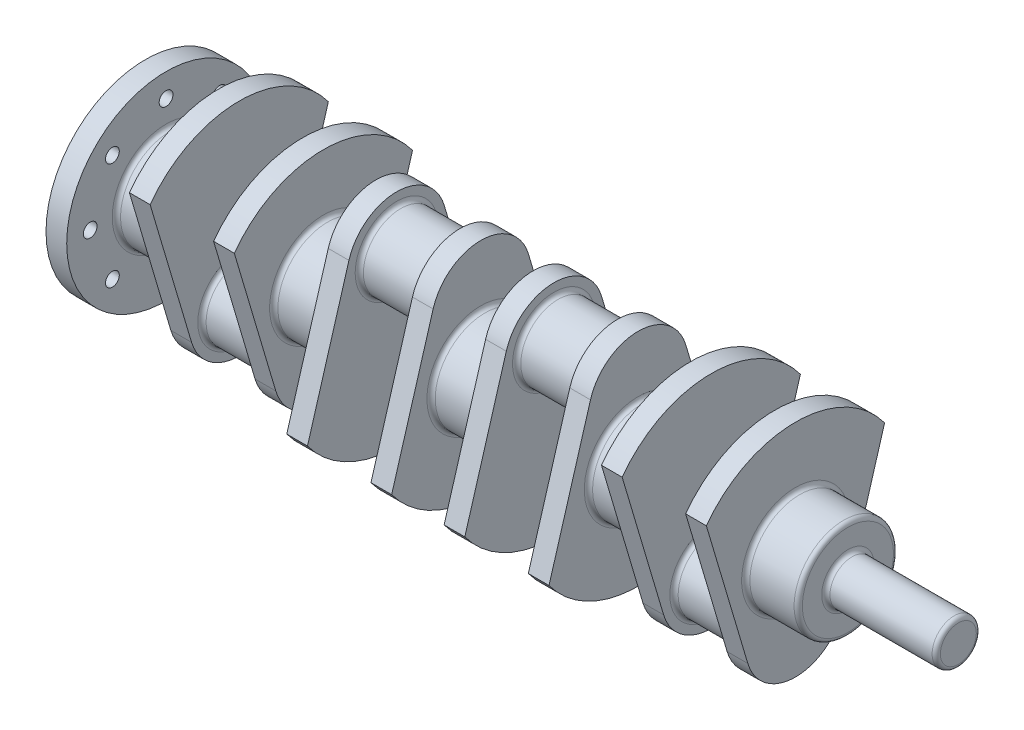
ISO-10303-21;
HEADER;
FILE_DESCRIPTION(('STEP AP214'),'2;1');
FILE_NAME('part.step','',(''),(''),'','','');
FILE_SCHEMA(('AUTOMOTIVE_DESIGN { 1 0 10303 214 1 1 1 1 }'));
ENDSEC;
DATA;
#1=APPLICATION_CONTEXT('core data for automotive mechanical design processes');
#2=APPLICATION_PROTOCOL_DEFINITION('international standard','automotive_design',2000,#1);
#3=PRODUCT_CONTEXT('',#1,'mechanical');
#4=PRODUCT('Part','Part','',(#3));
#5=PRODUCT_RELATED_PRODUCT_CATEGORY('part','',(#4));
#6=PRODUCT_DEFINITION_FORMATION('','',#4);
#7=PRODUCT_DEFINITION_CONTEXT('part definition',#1,'design');
#8=PRODUCT_DEFINITION('design','',#6,#7);
#9=PRODUCT_DEFINITION_SHAPE('','',#8);
#10=(LENGTH_UNIT() NAMED_UNIT(*) SI_UNIT(.MILLI.,.METRE.));
#11=(NAMED_UNIT(*) PLANE_ANGLE_UNIT() SI_UNIT($,.RADIAN.));
#12=(NAMED_UNIT(*) SI_UNIT($,.STERADIAN.) SOLID_ANGLE_UNIT());
#13=UNCERTAINTY_MEASURE_WITH_UNIT(LENGTH_MEASURE(1.E-05),#10,'distance_accuracy_value','');
#14=(GEOMETRIC_REPRESENTATION_CONTEXT(3) GLOBAL_UNCERTAINTY_ASSIGNED_CONTEXT((#13)) GLOBAL_UNIT_ASSIGNED_CONTEXT((#10,
#11,#12)) REPRESENTATION_CONTEXT('',''));
#15=CARTESIAN_POINT('',(0.,0.,0.));
#16=DIRECTION('',(0.,0.,1.));
#17=DIRECTION('',(1.,0.,0.));
#18=AXIS2_PLACEMENT_3D('',#15,#16,#17);
#19=CARTESIAN_POINT('',(15.,-13.7737999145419,-46.4995692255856));
#20=DIRECTION('',(0.,-0.284015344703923,-0.958819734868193));
#21=DIRECTION('',(0.,0.958819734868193,-0.284015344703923));
#22=AXIS2_PLACEMENT_3D('',#19,#20,#21);
#23=PLANE('',#22);
#24=DIRECTION('',(0.,-0.958819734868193,0.284015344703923));
#25=VECTOR('',#24,1.);
#26=CARTESIAN_POINT('',(0.,-13.7737999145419,-46.4995692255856));
#27=LINE('',#26,#25);
#28=CARTESIAN_POINT('',(0.,47.2305923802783,-64.5698934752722));
#29=VERTEX_POINT('',#28);
#30=CARTESIAN_POINT('',(0.,-54.2245524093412,-34.517510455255));
#31=VERTEX_POINT('',#30);
#32=EDGE_CURVE('E578',#29,#31,#27,.T.);
#33=ORIENTED_EDGE('',*,*,#32,.F.);
#34=DIRECTION('',(-1.,0.,0.));
#35=VECTOR('',#34,1.);
#36=CARTESIAN_POINT('',(15.,47.2305923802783,-64.5698934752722));
#37=LINE('',#36,#35);
#38=CARTESIAN_POINT('',(15.,47.2305923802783,-64.5698934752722));
#39=VERTEX_POINT('',#38);
#40=EDGE_CURVE('E94',#39,#29,#37,.T.);
#41=ORIENTED_EDGE('',*,*,#40,.F.);
#42=DIRECTION('',(0.,-0.958819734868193,0.284015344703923));
#43=VECTOR('',#42,1.);
#44=CARTESIAN_POINT('',(15.,-13.7737999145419,-46.4995692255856));
#45=LINE('',#44,#43);
#46=CARTESIAN_POINT('',(15.,-54.2245524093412,-34.517510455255));
#47=VERTEX_POINT('',#46);
#48=EDGE_CURVE('E579',#39,#47,#45,.T.);
#49=ORIENTED_EDGE('',*,*,#48,.T.);
#50=DIRECTION('',(-1.,0.,0.));
#51=VECTOR('',#50,1.);
#52=CARTESIAN_POINT('',(15.,-54.2245524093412,-34.517510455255));
#53=LINE('',#52,#51);
#54=EDGE_CURVE('E90',#47,#31,#53,.T.);
#55=ORIENTED_EDGE('',*,*,#54,.T.);
#56=EDGE_LOOP('',(#33,#41,#49,#55));
#57=FACE_BOUND('',#56,.T.);
#58=ADVANCED_FACE('F47',(#57),#23,.T.);
#59=CARTESIAN_POINT('',(15.,0.,0.));
#60=DIRECTION('',(-1.,0.,0.));
#61=DIRECTION('',(0.,0.,1.));
#62=AXIS2_PLACEMENT_3D('',#59,#60,#61);
#63=CYLINDRICAL_SURFACE('',#62,80.);
#64=CARTESIAN_POINT('',(0.,0.,0.));
#65=DIRECTION('',(1.,0.,0.));
#66=DIRECTION('',(0.,0.,-1.));
#67=AXIS2_PLACEMENT_3D('',#64,#65,#66);
#68=CIRCLE('',#67,80.);
#69=CARTESIAN_POINT('',(0.,47.2305923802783,64.5698934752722));
#70=VERTEX_POINT('',#69);
#71=EDGE_CURVE('E594',#29,#70,#68,.T.);
#72=ORIENTED_EDGE('',*,*,#71,.T.);
#73=DIRECTION('',(-1.,0.,0.));
#74=VECTOR('',#73,1.);
#75=CARTESIAN_POINT('',(15.,47.2305923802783,64.5698934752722));
#76=LINE('',#75,#74);
#77=CARTESIAN_POINT('',(15.,47.2305923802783,64.5698934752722));
#78=VERTEX_POINT('',#77);
#79=EDGE_CURVE('E606',#78,#70,#76,.T.);
#80=ORIENTED_EDGE('',*,*,#79,.F.);
#81=CARTESIAN_POINT('',(15.,0.,0.));
#82=DIRECTION('',(1.,0.,0.));
#83=DIRECTION('',(0.,0.,-1.));
#84=AXIS2_PLACEMENT_3D('',#81,#82,#83);
#85=CIRCLE('',#84,80.);
#86=EDGE_CURVE('E582',#39,#78,#85,.T.);
#87=ORIENTED_EDGE('',*,*,#86,.F.);
#88=ORIENTED_EDGE('',*,*,#40,.T.);
#89=EDGE_LOOP('',(#72,#80,#87,#88));
#90=FACE_BOUND('',#89,.T.);
#91=ADVANCED_FACE('F799',(#90),#63,.T.);
#92=CARTESIAN_POINT('',(15.,-13.7737999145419,46.4995692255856));
#93=DIRECTION('',(0.,0.284015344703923,-0.958819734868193));
#94=DIRECTION('',(0.,0.958819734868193,0.284015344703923));
#95=AXIS2_PLACEMENT_3D('',#92,#93,#94);
#96=PLANE('',#95);
#97=DIRECTION('',(0.,-0.958819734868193,-0.284015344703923));
#98=VECTOR('',#97,1.);
#99=CARTESIAN_POINT('',(0.,-13.7737999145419,46.4995692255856));
#100=LINE('',#99,#98);
#101=CARTESIAN_POINT('',(0.,-54.2245524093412,34.517510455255));
#102=VERTEX_POINT('',#101);
#103=EDGE_CURVE('E83',#70,#102,#100,.T.);
#104=ORIENTED_EDGE('',*,*,#103,.T.);
#105=DIRECTION('',(-1.,0.,0.));
#106=VECTOR('',#105,1.);
#107=CARTESIAN_POINT('',(15.,-54.2245524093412,34.517510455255));
#108=LINE('',#107,#106);
#109=CARTESIAN_POINT('',(15.,-54.2245524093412,34.517510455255));
#110=VERTEX_POINT('',#109);
#111=EDGE_CURVE('E603',#110,#102,#108,.T.);
#112=ORIENTED_EDGE('',*,*,#111,.F.);
#113=DIRECTION('',(0.,-0.958819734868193,-0.284015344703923));
#114=VECTOR('',#113,1.);
#115=CARTESIAN_POINT('',(15.,-13.7737999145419,46.4995692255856));
#116=LINE('',#115,#114);
#117=EDGE_CURVE('E586',#78,#110,#116,.T.);
#118=ORIENTED_EDGE('',*,*,#117,.F.);
#119=ORIENTED_EDGE('',*,*,#79,.T.);
#120=EDGE_LOOP('',(#104,#112,#118,#119));
#121=FACE_BOUND('',#120,.T.);
#122=ADVANCED_FACE('F804',(#121),#96,.F.);
#123=CARTESIAN_POINT('',(15.,-44.,0.));
#124=DIRECTION('',(-1.,0.,0.));
#125=DIRECTION('',(0.,0.,1.));
#126=AXIS2_PLACEMENT_3D('',#123,#124,#125);
#127=CYLINDRICAL_SURFACE('',#126,36.);
#128=CARTESIAN_POINT('',(0.,-44.,0.));
#129=DIRECTION('',(1.,0.,0.));
#130=DIRECTION('',(0.,0.,-1.));
#131=AXIS2_PLACEMENT_3D('',#128,#129,#130);
#132=CIRCLE('',#131,36.);
#133=EDGE_CURVE('E583',#102,#31,#132,.T.);
#134=ORIENTED_EDGE('',*,*,#133,.T.);
#135=ORIENTED_EDGE('',*,*,#54,.F.);
#136=CARTESIAN_POINT('',(15.,-44.,0.));
#137=DIRECTION('',(1.,0.,0.));
#138=DIRECTION('',(0.,0.,-1.));
#139=AXIS2_PLACEMENT_3D('',#136,#137,#138);
#140=CIRCLE('',#139,36.);
#141=EDGE_CURVE('E65',#110,#47,#140,.T.);
#142=ORIENTED_EDGE('',*,*,#141,.F.);
#143=ORIENTED_EDGE('',*,*,#111,.T.);
#144=EDGE_LOOP('',(#134,#135,#142,#143));
#145=FACE_BOUND('',#144,.T.);
#146=ADVANCED_FACE('F906',(#145),#127,.T.);
#147=CARTESIAN_POINT('',(15.,0.,0.));
#148=DIRECTION('',(1.,0.,0.));
#149=DIRECTION('',(0.,0.,-1.));
#150=AXIS2_PLACEMENT_3D('',#147,#148,#149);
#151=PLANE('',#150);
#152=CARTESIAN_POINT('',(15.,0.,0.));
#153=DIRECTION('',(1.,0.,0.));
#154=DIRECTION('',(0.,0.,-1.));
#155=AXIS2_PLACEMENT_3D('',#152,#153,#154);
#156=CIRCLE('',#155,39.);
#157=CARTESIAN_POINT('',(15.,0.,-39.));
#158=VERTEX_POINT('',#157);
#159=EDGE_CURVE('E747',#158,#158,#156,.F.);
#160=ORIENTED_EDGE('',*,*,#159,.T.);
#161=EDGE_LOOP('',(#160));
#162=FACE_BOUND('',#161,.T.);
#163=ORIENTED_EDGE('',*,*,#48,.F.);
#164=ORIENTED_EDGE('',*,*,#86,.T.);
#165=ORIENTED_EDGE('',*,*,#117,.T.);
#166=ORIENTED_EDGE('',*,*,#141,.T.);
#167=EDGE_LOOP('',(#163,#164,#165,#166));
#168=FACE_BOUND('',#167,.T.);
#169=ADVANCED_FACE('F903',(#162,#168),#151,.T.);
#170=CARTESIAN_POINT('',(0.,0.,0.));
#171=DIRECTION('',(1.,0.,0.));
#172=DIRECTION('',(0.,0.,-1.));
#173=AXIS2_PLACEMENT_3D('',#170,#171,#172);
#174=PLANE('',#173);
#175=CARTESIAN_POINT('',(0.,-44.,0.));
#176=DIRECTION('',(1.,0.,0.));
#177=DIRECTION('',(0.,0.,-1.));
#178=AXIS2_PLACEMENT_3D('',#175,#176,#177);
#179=CIRCLE('',#178,30.);
#180=CARTESIAN_POINT('',(0.,-44.,-30.));
#181=VERTEX_POINT('',#180);
#182=EDGE_CURVE('E735',#181,#181,#179,.T.);
#183=ORIENTED_EDGE('',*,*,#182,.T.);
#184=EDGE_LOOP('',(#183));
#185=FACE_BOUND('',#184,.T.);
#186=ORIENTED_EDGE('',*,*,#32,.T.);
#187=ORIENTED_EDGE('',*,*,#133,.F.);
#188=ORIENTED_EDGE('',*,*,#103,.F.);
#189=ORIENTED_EDGE('',*,*,#71,.F.);
#190=EDGE_LOOP('',(#186,#187,#188,#189));
#191=FACE_BOUND('',#190,.T.);
#192=ADVANCED_FACE('F901',(#185,#191),#174,.F.);
#193=CARTESIAN_POINT('',(-46.,-44.,0.));
#194=DIRECTION('',(1.,0.,0.));
#195=DIRECTION('',(0.,0.,-1.));
#196=AXIS2_PLACEMENT_3D('',#193,#194,#195);
#197=CYLINDRICAL_SURFACE('',#196,27.);
#198=CARTESIAN_POINT('',(-43.,-44.,0.));
#199=DIRECTION('',(-1.,0.,0.));
#200=DIRECTION('',(0.,0.,1.));
#201=AXIS2_PLACEMENT_3D('',#198,#199,#200);
#202=CIRCLE('',#201,27.);
#203=CARTESIAN_POINT('',(-43.,-44.,27.));
#204=VERTEX_POINT('',#203);
#205=EDGE_CURVE('E731',#204,#204,#202,.F.);
#206=ORIENTED_EDGE('',*,*,#205,.T.);
#207=EDGE_LOOP('',(#206));
#208=FACE_BOUND('',#207,.T.);
#209=CARTESIAN_POINT('',(-3.,-44.,0.));
#210=DIRECTION('',(1.,0.,0.));
#211=DIRECTION('',(0.,0.,-1.));
#212=AXIS2_PLACEMENT_3D('',#209,#210,#211);
#213=CIRCLE('',#212,27.);
#214=CARTESIAN_POINT('',(-3.,-44.,-27.));
#215=VERTEX_POINT('',#214);
#216=EDGE_CURVE('E727',#215,#215,#213,.F.);
#217=ORIENTED_EDGE('',*,*,#216,.T.);
#218=EDGE_LOOP('',(#217));
#219=FACE_BOUND('',#218,.T.);
#220=ADVANCED_FACE('F894',(#208,#219),#197,.T.);
#221=CARTESIAN_POINT('',(53.,0.,0.));
#222=DIRECTION('',(-1.,0.,0.));
#223=DIRECTION('',(0.,0.,1.));
#224=AXIS2_PLACEMENT_3D('',#221,#222,#223);
#225=CYLINDRICAL_SURFACE('',#224,36.);
#226=CARTESIAN_POINT('',(18.,0.,0.));
#227=DIRECTION('',(1.,0.,0.));
#228=DIRECTION('',(0.,0.,-1.));
#229=AXIS2_PLACEMENT_3D('',#226,#227,#228);
#230=CIRCLE('',#229,36.);
#231=CARTESIAN_POINT('',(18.,0.,-36.));
#232=VERTEX_POINT('',#231);
#233=EDGE_CURVE('E743',#232,#232,#230,.T.);
#234=ORIENTED_EDGE('',*,*,#233,.T.);
#235=EDGE_LOOP('',(#234));
#236=FACE_BOUND('',#235,.T.);
#237=CARTESIAN_POINT('',(50.,0.,0.));
#238=DIRECTION('',(1.,0.,0.));
#239=DIRECTION('',(0.,0.,-1.));
#240=AXIS2_PLACEMENT_3D('',#237,#238,#239);
#241=CIRCLE('',#240,36.);
#242=CARTESIAN_POINT('',(50.,0.,-36.));
#243=VERTEX_POINT('',#242);
#244=EDGE_CURVE('E739',#243,#243,#241,.F.);
#245=ORIENTED_EDGE('',*,*,#244,.T.);
#246=EDGE_LOOP('',(#245));
#247=FACE_BOUND('',#246,.T.);
#248=ADVANCED_FACE('F885',(#236,#247),#225,.T.);
#249=CARTESIAN_POINT('',(53.,0.,0.));
#250=DIRECTION('',(1.,0.,0.));
#251=DIRECTION('',(0.,0.,-1.));
#252=AXIS2_PLACEMENT_3D('',#249,#250,#251);
#253=PLANE('',#252);
#254=CARTESIAN_POINT('',(53.,0.,0.));
#255=DIRECTION('',(1.,0.,0.));
#256=DIRECTION('',(0.,0.,-1.));
#257=AXIS2_PLACEMENT_3D('',#254,#255,#256);
#258=CIRCLE('',#257,19.);
#259=CARTESIAN_POINT('',(53.,0.,-19.));
#260=VERTEX_POINT('',#259);
#261=EDGE_CURVE('E57',#260,#260,#258,.F.);
#262=ORIENTED_EDGE('',*,*,#261,.T.);
#263=EDGE_LOOP('',(#262));
#264=FACE_BOUND('',#263,.T.);
#265=CARTESIAN_POINT('',(53.,0.,0.));
#266=DIRECTION('',(1.,0.,0.));
#267=DIRECTION('',(0.,0.,-1.));
#268=AXIS2_PLACEMENT_3D('',#265,#266,#267);
#269=CIRCLE('',#268,33.);
#270=CARTESIAN_POINT('',(53.,0.,-33.));
#271=VERTEX_POINT('',#270);
#272=EDGE_CURVE('E759',#271,#271,#269,.T.);
#273=ORIENTED_EDGE('',*,*,#272,.T.);
#274=EDGE_LOOP('',(#273));
#275=FACE_BOUND('',#274,.T.);
#276=ADVANCED_FACE('F766',(#264,#275),#253,.T.);
#277=CARTESIAN_POINT('',(-61.,-13.7737999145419,-46.4995692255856));
#278=DIRECTION('',(0.,-0.284015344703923,-0.958819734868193));
#279=DIRECTION('',(0.,0.958819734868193,-0.284015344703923));
#280=AXIS2_PLACEMENT_3D('',#277,#278,#279);
#281=PLANE('',#280);
#282=DIRECTION('',(0.,-0.958819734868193,0.284015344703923));
#283=VECTOR('',#282,1.);
#284=CARTESIAN_POINT('',(-46.,-13.7737999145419,-46.4995692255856));
#285=LINE('',#284,#283);
#286=CARTESIAN_POINT('',(-46.,47.2305923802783,-64.5698934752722));
#287=VERTEX_POINT('',#286);
#288=CARTESIAN_POINT('',(-46.,-54.2245524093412,-34.517510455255));
#289=VERTEX_POINT('',#288);
#290=EDGE_CURVE('E532',#287,#289,#285,.T.);
#291=ORIENTED_EDGE('',*,*,#290,.T.);
#292=DIRECTION('',(1.,0.,0.));
#293=VECTOR('',#292,1.);
#294=CARTESIAN_POINT('',(-61.,-54.2245524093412,-34.517510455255));
#295=LINE('',#294,#293);
#296=CARTESIAN_POINT('',(-61.,-54.2245524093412,-34.517510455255));
#297=VERTEX_POINT('',#296);
#298=EDGE_CURVE('E549',#297,#289,#295,.T.);
#299=ORIENTED_EDGE('',*,*,#298,.F.);
#300=DIRECTION('',(0.,-0.958819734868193,0.284015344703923));
#301=VECTOR('',#300,1.);
#302=CARTESIAN_POINT('',(-61.,-13.7737999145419,-46.4995692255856));
#303=LINE('',#302,#301);
#304=CARTESIAN_POINT('',(-61.,47.2305923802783,-64.5698934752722));
#305=VERTEX_POINT('',#304);
#306=EDGE_CURVE('E533',#305,#297,#303,.T.);
#307=ORIENTED_EDGE('',*,*,#306,.F.);
#308=DIRECTION('',(1.,0.,0.));
#309=VECTOR('',#308,1.);
#310=CARTESIAN_POINT('',(-61.,47.2305923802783,-64.5698934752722));
#311=LINE('',#310,#309);
#312=EDGE_CURVE('E574',#305,#287,#311,.T.);
#313=ORIENTED_EDGE('',*,*,#312,.T.);
#314=EDGE_LOOP('',(#291,#299,#307,#313));
#315=FACE_BOUND('',#314,.T.);
#316=ADVANCED_FACE('F884',(#315),#281,.T.);
#317=CARTESIAN_POINT('',(-61.,0.,0.));
#318=DIRECTION('',(1.,0.,0.));
#319=DIRECTION('',(0.,0.,1.));
#320=AXIS2_PLACEMENT_3D('',#317,#318,#319);
#321=CYLINDRICAL_SURFACE('',#320,80.);
#322=CARTESIAN_POINT('',(-46.,0.,0.));
#323=DIRECTION('',(1.,0.,0.));
#324=DIRECTION('',(0.,0.,-1.));
#325=AXIS2_PLACEMENT_3D('',#322,#323,#324);
#326=CIRCLE('',#325,80.);
#327=CARTESIAN_POINT('',(-46.,47.2305923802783,64.5698934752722));
#328=VERTEX_POINT('',#327);
#329=EDGE_CURVE('E553',#287,#328,#326,.T.);
#330=ORIENTED_EDGE('',*,*,#329,.F.);
#331=ORIENTED_EDGE('',*,*,#312,.F.);
#332=CARTESIAN_POINT('',(-61.,0.,0.));
#333=DIRECTION('',(1.,0.,0.));
#334=DIRECTION('',(0.,0.,-1.));
#335=AXIS2_PLACEMENT_3D('',#332,#333,#334);
#336=CIRCLE('',#335,80.);
#337=CARTESIAN_POINT('',(-61.,47.2305923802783,64.5698934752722));
#338=VERTEX_POINT('',#337);
#339=EDGE_CURVE('E537',#305,#338,#336,.T.);
#340=ORIENTED_EDGE('',*,*,#339,.T.);
#341=DIRECTION('',(1.,0.,0.));
#342=VECTOR('',#341,1.);
#343=CARTESIAN_POINT('',(-61.,47.2305923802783,64.5698934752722));
#344=LINE('',#343,#342);
#345=EDGE_CURVE('E570',#338,#328,#344,.T.);
#346=ORIENTED_EDGE('',*,*,#345,.T.);
#347=EDGE_LOOP('',(#330,#331,#340,#346));
#348=FACE_BOUND('',#347,.T.);
#349=ADVANCED_FACE('F891',(#348),#321,.T.);
#350=CARTESIAN_POINT('',(-61.,-13.7737999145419,46.4995692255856));
#351=DIRECTION('',(0.,0.284015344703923,-0.958819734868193));
#352=DIRECTION('',(0.,0.958819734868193,0.284015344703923));
#353=AXIS2_PLACEMENT_3D('',#350,#351,#352);
#354=PLANE('',#353);
#355=DIRECTION('',(0.,-0.958819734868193,-0.284015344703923));
#356=VECTOR('',#355,1.);
#357=CARTESIAN_POINT('',(-46.,-13.7737999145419,46.4995692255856));
#358=LINE('',#357,#356);
#359=CARTESIAN_POINT('',(-46.,-54.2245524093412,34.517510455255));
#360=VERTEX_POINT('',#359);
#361=EDGE_CURVE('E557',#328,#360,#358,.T.);
#362=ORIENTED_EDGE('',*,*,#361,.F.);
#363=ORIENTED_EDGE('',*,*,#345,.F.);
#364=DIRECTION('',(0.,-0.958819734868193,-0.284015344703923));
#365=VECTOR('',#364,1.);
#366=CARTESIAN_POINT('',(-61.,-13.7737999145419,46.4995692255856));
#367=LINE('',#366,#365);
#368=CARTESIAN_POINT('',(-61.,-54.2245524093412,34.517510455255));
#369=VERTEX_POINT('',#368);
#370=EDGE_CURVE('E542',#338,#369,#367,.T.);
#371=ORIENTED_EDGE('',*,*,#370,.T.);
#372=DIRECTION('',(1.,0.,0.));
#373=VECTOR('',#372,1.);
#374=CARTESIAN_POINT('',(-61.,-54.2245524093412,34.517510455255));
#375=LINE('',#374,#373);
#376=EDGE_CURVE('E566',#369,#360,#375,.T.);
#377=ORIENTED_EDGE('',*,*,#376,.T.);
#378=EDGE_LOOP('',(#362,#363,#371,#377));
#379=FACE_BOUND('',#378,.T.);
#380=ADVANCED_FACE('F1816',(#379),#354,.F.);
#381=CARTESIAN_POINT('',(-61.,-44.,0.));
#382=DIRECTION('',(1.,0.,0.));
#383=DIRECTION('',(0.,0.,1.));
#384=AXIS2_PLACEMENT_3D('',#381,#382,#383);
#385=CYLINDRICAL_SURFACE('',#384,36.);
#386=CARTESIAN_POINT('',(-46.,-44.,0.));
#387=DIRECTION('',(1.,0.,0.));
#388=DIRECTION('',(0.,0.,-1.));
#389=AXIS2_PLACEMENT_3D('',#386,#387,#388);
#390=CIRCLE('',#389,36.);
#391=EDGE_CURVE('E538',#360,#289,#390,.T.);
#392=ORIENTED_EDGE('',*,*,#391,.F.);
#393=ORIENTED_EDGE('',*,*,#376,.F.);
#394=CARTESIAN_POINT('',(-61.,-44.,0.));
#395=DIRECTION('',(1.,0.,0.));
#396=DIRECTION('',(0.,0.,-1.));
#397=AXIS2_PLACEMENT_3D('',#394,#395,#396);
#398=CIRCLE('',#397,36.);
#399=EDGE_CURVE('E546',#369,#297,#398,.T.);
#400=ORIENTED_EDGE('',*,*,#399,.T.);
#401=ORIENTED_EDGE('',*,*,#298,.T.);
#402=EDGE_LOOP('',(#392,#393,#400,#401));
#403=FACE_BOUND('',#402,.T.);
#404=ADVANCED_FACE('F958',(#403),#385,.T.);
#405=CARTESIAN_POINT('',(-61.,0.,0.));
#406=DIRECTION('',(-1.,0.,0.));
#407=DIRECTION('',(0.,0.,-1.));
#408=AXIS2_PLACEMENT_3D('',#405,#406,#407);
#409=PLANE('',#408);
#410=CARTESIAN_POINT('',(-61.,0.,0.));
#411=DIRECTION('',(-1.,0.,0.));
#412=DIRECTION('',(0.,0.,1.));
#413=AXIS2_PLACEMENT_3D('',#410,#411,#412);
#414=CIRCLE('',#413,39.);
#415=CARTESIAN_POINT('',(-61.,0.,39.));
#416=VERTEX_POINT('',#415);
#417=EDGE_CURVE('E719',#416,#416,#414,.F.);
#418=ORIENTED_EDGE('',*,*,#417,.T.);
#419=EDGE_LOOP('',(#418));
#420=FACE_BOUND('',#419,.T.);
#421=ORIENTED_EDGE('',*,*,#306,.T.);
#422=ORIENTED_EDGE('',*,*,#399,.F.);
#423=ORIENTED_EDGE('',*,*,#370,.F.);
#424=ORIENTED_EDGE('',*,*,#339,.F.);
#425=EDGE_LOOP('',(#421,#422,#423,#424));
#426=FACE_BOUND('',#425,.T.);
#427=ADVANCED_FACE('F952',(#420,#426),#409,.T.);
#428=CARTESIAN_POINT('',(-46.,0.,0.));
#429=DIRECTION('',(-1.,0.,0.));
#430=DIRECTION('',(0.,0.,-1.));
#431=AXIS2_PLACEMENT_3D('',#428,#429,#430);
#432=PLANE('',#431);
#433=CARTESIAN_POINT('',(-46.,-44.,0.));
#434=DIRECTION('',(-1.,0.,0.));
#435=DIRECTION('',(0.,0.,1.));
#436=AXIS2_PLACEMENT_3D('',#433,#434,#435);
#437=CIRCLE('',#436,30.);
#438=CARTESIAN_POINT('',(-46.,-44.,30.));
#439=VERTEX_POINT('',#438);
#440=EDGE_CURVE('E723',#439,#439,#437,.T.);
#441=ORIENTED_EDGE('',*,*,#440,.T.);
#442=EDGE_LOOP('',(#441));
#443=FACE_BOUND('',#442,.T.);
#444=ORIENTED_EDGE('',*,*,#290,.F.);
#445=ORIENTED_EDGE('',*,*,#329,.T.);
#446=ORIENTED_EDGE('',*,*,#361,.T.);
#447=ORIENTED_EDGE('',*,*,#391,.T.);
#448=EDGE_LOOP('',(#444,#445,#446,#447));
#449=FACE_BOUND('',#448,.T.);
#450=ADVANCED_FACE('F957',(#443,#449),#432,.F.);
#451=CARTESIAN_POINT('',(-99.,0.,0.));
#452=DIRECTION('',(1.,0.,0.));
#453=DIRECTION('',(0.,0.,1.));
#454=AXIS2_PLACEMENT_3D('',#451,#452,#453);
#455=CYLINDRICAL_SURFACE('',#454,36.);
#456=CARTESIAN_POINT('',(-96.,0.,0.));
#457=DIRECTION('',(1.,0.,0.));
#458=DIRECTION('',(0.,0.,-1.));
#459=AXIS2_PLACEMENT_3D('',#456,#457,#458);
#460=CIRCLE('',#459,36.);
#461=CARTESIAN_POINT('',(-96.,0.,-36.));
#462=VERTEX_POINT('',#461);
#463=EDGE_CURVE('E691',#462,#462,#460,.T.);
#464=ORIENTED_EDGE('',*,*,#463,.T.);
#465=EDGE_LOOP('',(#464));
#466=FACE_BOUND('',#465,.T.);
#467=CARTESIAN_POINT('',(-64.,0.,0.));
#468=DIRECTION('',(-1.,0.,0.));
#469=DIRECTION('',(0.,0.,1.));
#470=AXIS2_PLACEMENT_3D('',#467,#468,#469);
#471=CIRCLE('',#470,36.);
#472=CARTESIAN_POINT('',(-64.,0.,36.));
#473=VERTEX_POINT('',#472);
#474=EDGE_CURVE('E687',#473,#473,#471,.T.);
#475=ORIENTED_EDGE('',*,*,#474,.T.);
#476=EDGE_LOOP('',(#475));
#477=FACE_BOUND('',#476,.T.);
#478=ADVANCED_FACE('F781',(#466,#477),#455,.T.);
#479=CARTESIAN_POINT('',(133.,0.,0.));
#480=DIRECTION('',(-1.,0.,0.));
#481=DIRECTION('',(0.,0.,1.));
#482=AXIS2_PLACEMENT_3D('',#479,#480,#481);
#483=CYLINDRICAL_SURFACE('',#482,16.);
#484=CARTESIAN_POINT('',(56.,0.,0.));
#485=DIRECTION('',(1.,0.,0.));
#486=DIRECTION('',(0.,0.,-1.));
#487=AXIS2_PLACEMENT_3D('',#484,#485,#486);
#488=CIRCLE('',#487,16.);
#489=CARTESIAN_POINT('',(56.,0.,-16.));
#490=VERTEX_POINT('',#489);
#491=EDGE_CURVE('E755',#490,#490,#488,.T.);
#492=ORIENTED_EDGE('',*,*,#491,.T.);
#493=EDGE_LOOP('',(#492));
#494=FACE_BOUND('',#493,.T.);
#495=CARTESIAN_POINT('',(130.,0.,0.));
#496=DIRECTION('',(1.,0.,0.));
#497=DIRECTION('',(0.,0.,-1.));
#498=AXIS2_PLACEMENT_3D('',#495,#496,#497);
#499=CIRCLE('',#498,16.);
#500=CARTESIAN_POINT('',(130.,0.,-16.));
#501=VERTEX_POINT('',#500);
#502=EDGE_CURVE('E751',#501,#501,#499,.F.);
#503=ORIENTED_EDGE('',*,*,#502,.T.);
#504=EDGE_LOOP('',(#503));
#505=FACE_BOUND('',#504,.T.);
#506=ADVANCED_FACE('F777',(#494,#505),#483,.T.);
#507=CARTESIAN_POINT('',(133.,0.,0.));
#508=DIRECTION('',(1.,0.,0.));
#509=DIRECTION('',(0.,0.,-1.));
#510=AXIS2_PLACEMENT_3D('',#507,#508,#509);
#511=PLANE('',#510);
#512=CARTESIAN_POINT('',(133.,0.,0.));
#513=DIRECTION('',(1.,0.,0.));
#514=DIRECTION('',(0.,0.,-1.));
#515=AXIS2_PLACEMENT_3D('',#512,#513,#514);
#516=CIRCLE('',#515,13.);
#517=CARTESIAN_POINT('',(133.,0.,-13.));
#518=VERTEX_POINT('',#517);
#519=EDGE_CURVE('E11',#518,#518,#516,.T.);
#520=ORIENTED_EDGE('',*,*,#519,.T.);
#521=EDGE_LOOP('',(#520));
#522=FACE_BOUND('',#521,.T.);
#523=ADVANCED_FACE('F780',(#522),#511,.T.);
#524=CARTESIAN_POINT('',(-175.,13.7737999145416,46.4995692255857));
#525=DIRECTION('',(0.,0.284015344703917,0.958819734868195));
#526=DIRECTION('',(0.,-0.958819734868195,0.284015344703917));
#527=AXIS2_PLACEMENT_3D('',#524,#525,#526);
#528=PLANE('',#527);
#529=DIRECTION('',(0.,0.958819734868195,-0.284015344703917));
#530=VECTOR('',#529,1.);
#531=CARTESIAN_POINT('',(-160.,13.7737999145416,46.4995692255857));
#532=LINE('',#531,#530);
#533=CARTESIAN_POINT('',(-160.,-47.2305923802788,64.5698934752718));
#534=VERTEX_POINT('',#533);
#535=CARTESIAN_POINT('',(-160.,54.224552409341,34.5175104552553));
#536=VERTEX_POINT('',#535);
#537=EDGE_CURVE('E486',#534,#536,#532,.T.);
#538=ORIENTED_EDGE('',*,*,#537,.T.);
#539=DIRECTION('',(1.,0.,0.));
#540=VECTOR('',#539,1.);
#541=CARTESIAN_POINT('',(-175.,54.224552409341,34.5175104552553));
#542=LINE('',#541,#540);
#543=CARTESIAN_POINT('',(-175.,54.224552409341,34.5175104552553));
#544=VERTEX_POINT('',#543);
#545=EDGE_CURVE('E503',#544,#536,#542,.T.);
#546=ORIENTED_EDGE('',*,*,#545,.F.);
#547=DIRECTION('',(0.,0.958819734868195,-0.284015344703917));
#548=VECTOR('',#547,1.);
#549=CARTESIAN_POINT('',(-175.,13.7737999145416,46.4995692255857));
#550=LINE('',#549,#548);
#551=CARTESIAN_POINT('',(-175.,-47.2305923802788,64.5698934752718));
#552=VERTEX_POINT('',#551);
#553=EDGE_CURVE('E487',#552,#544,#550,.T.);
#554=ORIENTED_EDGE('',*,*,#553,.F.);
#555=DIRECTION('',(1.,0.,0.));
#556=VECTOR('',#555,1.);
#557=CARTESIAN_POINT('',(-175.,-47.2305923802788,64.5698934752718));
#558=LINE('',#557,#556);
#559=EDGE_CURVE('E528',#552,#534,#558,.T.);
#560=ORIENTED_EDGE('',*,*,#559,.T.);
#561=EDGE_LOOP('',(#538,#546,#554,#560));
#562=FACE_BOUND('',#561,.T.);
#563=ADVANCED_FACE('F790',(#562),#528,.T.);
#564=CARTESIAN_POINT('',(-175.,0.,0.));
#565=DIRECTION('',(1.,0.,0.));
#566=DIRECTION('',(0.,0.,-1.));
#567=AXIS2_PLACEMENT_3D('',#564,#565,#566);
#568=CYLINDRICAL_SURFACE('',#567,80.);
#569=CARTESIAN_POINT('',(-160.,0.,0.));
#570=DIRECTION('',(1.,0.,0.));
#571=DIRECTION('',(0.,0.,1.));
#572=AXIS2_PLACEMENT_3D('',#569,#570,#571);
#573=CIRCLE('',#572,80.);
#574=CARTESIAN_POINT('',(-160.,-47.2305923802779,-64.5698934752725));
#575=VERTEX_POINT('',#574);
#576=EDGE_CURVE('E507',#534,#575,#573,.T.);
#577=ORIENTED_EDGE('',*,*,#576,.F.);
#578=ORIENTED_EDGE('',*,*,#559,.F.);
#579=CARTESIAN_POINT('',(-175.,0.,0.));
#580=DIRECTION('',(1.,0.,0.));
#581=DIRECTION('',(0.,0.,1.));
#582=AXIS2_PLACEMENT_3D('',#579,#580,#581);
#583=CIRCLE('',#582,80.);
#584=CARTESIAN_POINT('',(-175.,-47.2305923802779,-64.5698934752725));
#585=VERTEX_POINT('',#584);
#586=EDGE_CURVE('E491',#552,#585,#583,.T.);
#587=ORIENTED_EDGE('',*,*,#586,.T.);
#588=DIRECTION('',(1.,0.,0.));
#589=VECTOR('',#588,1.);
#590=CARTESIAN_POINT('',(-175.,-47.2305923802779,-64.5698934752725));
#591=LINE('',#590,#589);
#592=EDGE_CURVE('E524',#585,#575,#591,.T.);
#593=ORIENTED_EDGE('',*,*,#592,.T.);
#594=EDGE_LOOP('',(#577,#578,#587,#593));
#595=FACE_BOUND('',#594,.T.);
#596=ADVANCED_FACE('F795',(#595),#568,.T.);
#597=CARTESIAN_POINT('',(-175.,13.7737999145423,-46.4995692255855));
#598=DIRECTION('',(0.,-0.28401534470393,0.958819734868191));
#599=DIRECTION('',(0.,-0.958819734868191,-0.28401534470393));
#600=AXIS2_PLACEMENT_3D('',#597,#598,#599);
#601=PLANE('',#600);
#602=DIRECTION('',(0.,0.958819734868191,0.28401534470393));
#603=VECTOR('',#602,1.);
#604=CARTESIAN_POINT('',(-160.,13.7737999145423,-46.4995692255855));
#605=LINE('',#604,#603);
#606=CARTESIAN_POINT('',(-160.,54.2245524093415,-34.5175104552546));
#607=VERTEX_POINT('',#606);
#608=EDGE_CURVE('E511',#575,#607,#605,.T.);
#609=ORIENTED_EDGE('',*,*,#608,.F.);
#610=ORIENTED_EDGE('',*,*,#592,.F.);
#611=DIRECTION('',(0.,0.958819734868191,0.28401534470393));
#612=VECTOR('',#611,1.);
#613=CARTESIAN_POINT('',(-175.,13.7737999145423,-46.4995692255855));
#614=LINE('',#613,#612);
#615=CARTESIAN_POINT('',(-175.,54.2245524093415,-34.5175104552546));
#616=VERTEX_POINT('',#615);
#617=EDGE_CURVE('E496',#585,#616,#614,.T.);
#618=ORIENTED_EDGE('',*,*,#617,.T.);
#619=DIRECTION('',(1.,0.,0.));
#620=VECTOR('',#619,1.);
#621=CARTESIAN_POINT('',(-175.,54.2245524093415,-34.5175104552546));
#622=LINE('',#621,#620);
#623=EDGE_CURVE('E520',#616,#607,#622,.T.);
#624=ORIENTED_EDGE('',*,*,#623,.T.);
#625=EDGE_LOOP('',(#609,#610,#618,#624));
#626=FACE_BOUND('',#625,.T.);
#627=ADVANCED_FACE('F1765',(#626),#601,.F.);
#628=CARTESIAN_POINT('',(-175.,44.,3.07250357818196E-13));
#629=DIRECTION('',(1.,0.,0.));
#630=DIRECTION('',(0.,0.,-1.));
#631=AXIS2_PLACEMENT_3D('',#628,#629,#630);
#632=CYLINDRICAL_SURFACE('',#631,36.);
#633=CARTESIAN_POINT('',(-160.,44.,3.07250357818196E-13));
#634=DIRECTION('',(1.,0.,0.));
#635=DIRECTION('',(0.,0.,1.));
#636=AXIS2_PLACEMENT_3D('',#633,#634,#635);
#637=CIRCLE('',#636,36.);
#638=EDGE_CURVE('E492',#607,#536,#637,.T.);
#639=ORIENTED_EDGE('',*,*,#638,.F.);
#640=ORIENTED_EDGE('',*,*,#623,.F.);
#641=CARTESIAN_POINT('',(-175.,44.,3.07250357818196E-13));
#642=DIRECTION('',(1.,0.,0.));
#643=DIRECTION('',(0.,0.,1.));
#644=AXIS2_PLACEMENT_3D('',#641,#642,#643);
#645=CIRCLE('',#644,36.);
#646=EDGE_CURVE('E500',#616,#544,#645,.T.);
#647=ORIENTED_EDGE('',*,*,#646,.T.);
#648=ORIENTED_EDGE('',*,*,#545,.T.);
#649=EDGE_LOOP('',(#639,#640,#647,#648));
#650=FACE_BOUND('',#649,.T.);
#651=ADVANCED_FACE('F1001',(#650),#632,.T.);
#652=CARTESIAN_POINT('',(-175.,0.,0.));
#653=DIRECTION('',(-1.,0.,0.));
#654=DIRECTION('',(0.,0.,1.));
#655=AXIS2_PLACEMENT_3D('',#652,#653,#654);
#656=PLANE('',#655);
#657=CARTESIAN_POINT('',(-175.,0.,0.));
#658=DIRECTION('',(-1.,0.,0.));
#659=DIRECTION('',(0.,0.,1.));
#660=AXIS2_PLACEMENT_3D('',#657,#658,#659);
#661=CIRCLE('',#660,39.);
#662=CARTESIAN_POINT('',(-175.,0.,39.));
#663=VERTEX_POINT('',#662);
#664=EDGE_CURVE('E715',#663,#663,#661,.F.);
#665=ORIENTED_EDGE('',*,*,#664,.T.);
#666=EDGE_LOOP('',(#665));
#667=FACE_BOUND('',#666,.T.);
#668=ORIENTED_EDGE('',*,*,#553,.T.);
#669=ORIENTED_EDGE('',*,*,#646,.F.);
#670=ORIENTED_EDGE('',*,*,#617,.F.);
#671=ORIENTED_EDGE('',*,*,#586,.F.);
#672=EDGE_LOOP('',(#668,#669,#670,#671));
#673=FACE_BOUND('',#672,.T.);
#674=ADVANCED_FACE('F995',(#667,#673),#656,.T.);
#675=CARTESIAN_POINT('',(-160.,0.,0.));
#676=DIRECTION('',(-1.,0.,0.));
#677=DIRECTION('',(0.,0.,1.));
#678=AXIS2_PLACEMENT_3D('',#675,#676,#677);
#679=PLANE('',#678);
#680=CARTESIAN_POINT('',(-160.,44.,3.07250357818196E-13));
#681=DIRECTION('',(-1.,0.,0.));
#682=DIRECTION('',(0.,0.,1.));
#683=AXIS2_PLACEMENT_3D('',#680,#681,#682);
#684=CIRCLE('',#683,30.);
#685=CARTESIAN_POINT('',(-160.,44.,30.0000000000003));
#686=VERTEX_POINT('',#685);
#687=EDGE_CURVE('E711',#686,#686,#684,.T.);
#688=ORIENTED_EDGE('',*,*,#687,.T.);
#689=EDGE_LOOP('',(#688));
#690=FACE_BOUND('',#689,.T.);
#691=ORIENTED_EDGE('',*,*,#537,.F.);
#692=ORIENTED_EDGE('',*,*,#576,.T.);
#693=ORIENTED_EDGE('',*,*,#608,.T.);
#694=ORIENTED_EDGE('',*,*,#638,.T.);
#695=EDGE_LOOP('',(#691,#692,#693,#694));
#696=FACE_BOUND('',#695,.T.);
#697=ADVANCED_FACE('F1000',(#690,#696),#679,.F.);
#698=CARTESIAN_POINT('',(-114.,44.,3.07250357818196E-13));
#699=DIRECTION('',(-1.,0.,0.));
#700=DIRECTION('',(0.,0.,1.));
#701=AXIS2_PLACEMENT_3D('',#698,#699,#700);
#702=CYLINDRICAL_SURFACE('',#701,27.);
#703=CARTESIAN_POINT('',(-117.,44.,3.07250357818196E-13));
#704=DIRECTION('',(1.,0.,0.));
#705=DIRECTION('',(0.,0.,-1.));
#706=AXIS2_PLACEMENT_3D('',#703,#704,#705);
#707=CIRCLE('',#706,27.);
#708=CARTESIAN_POINT('',(-117.,44.,-26.9999999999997));
#709=VERTEX_POINT('',#708);
#710=EDGE_CURVE('E703',#709,#709,#707,.F.);
#711=ORIENTED_EDGE('',*,*,#710,.T.);
#712=EDGE_LOOP('',(#711));
#713=FACE_BOUND('',#712,.T.);
#714=CARTESIAN_POINT('',(-157.,44.,3.07250357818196E-13));
#715=DIRECTION('',(-1.,0.,0.));
#716=DIRECTION('',(0.,0.,1.));
#717=AXIS2_PLACEMENT_3D('',#714,#715,#716);
#718=CIRCLE('',#717,27.);
#719=CARTESIAN_POINT('',(-157.,44.,27.0000000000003));
#720=VERTEX_POINT('',#719);
#721=EDGE_CURVE('E699',#720,#720,#718,.F.);
#722=ORIENTED_EDGE('',*,*,#721,.T.);
#723=EDGE_LOOP('',(#722));
#724=FACE_BOUND('',#723,.T.);
#725=ADVANCED_FACE('F1012',(#713,#724),#702,.T.);
#726=CARTESIAN_POINT('',(-213.,0.,0.));
#727=DIRECTION('',(1.,0.,0.));
#728=DIRECTION('',(0.,0.,-1.));
#729=AXIS2_PLACEMENT_3D('',#726,#727,#728);
#730=CYLINDRICAL_SURFACE('',#729,36.);
#731=CARTESIAN_POINT('',(-210.,0.,0.));
#732=DIRECTION('',(1.,0.,0.));
#733=DIRECTION('',(0.,0.,-1.));
#734=AXIS2_PLACEMENT_3D('',#731,#732,#733);
#735=CIRCLE('',#734,36.);
#736=CARTESIAN_POINT('',(-210.,0.,-36.));
#737=VERTEX_POINT('',#736);
#738=EDGE_CURVE('E679',#737,#737,#735,.T.);
#739=ORIENTED_EDGE('',*,*,#738,.T.);
#740=EDGE_LOOP('',(#739));
#741=FACE_BOUND('',#740,.T.);
#742=CARTESIAN_POINT('',(-178.,0.,0.));
#743=DIRECTION('',(-1.,0.,0.));
#744=DIRECTION('',(0.,0.,1.));
#745=AXIS2_PLACEMENT_3D('',#742,#743,#744);
#746=CIRCLE('',#745,36.);
#747=CARTESIAN_POINT('',(-178.,0.,36.));
#748=VERTEX_POINT('',#747);
#749=EDGE_CURVE('E675',#748,#748,#746,.T.);
#750=ORIENTED_EDGE('',*,*,#749,.T.);
#751=EDGE_LOOP('',(#750));
#752=FACE_BOUND('',#751,.T.);
#753=ADVANCED_FACE('F1021',(#741,#752),#730,.T.);
#754=CARTESIAN_POINT('',(-99.,13.7737999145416,46.4995692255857));
#755=DIRECTION('',(0.,0.284015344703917,0.958819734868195));
#756=DIRECTION('',(0.,-0.958819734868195,0.284015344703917));
#757=AXIS2_PLACEMENT_3D('',#754,#755,#756);
#758=PLANE('',#757);
#759=DIRECTION('',(0.,0.958819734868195,-0.284015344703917));
#760=VECTOR('',#759,1.);
#761=CARTESIAN_POINT('',(-114.,13.7737999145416,46.4995692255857));
#762=LINE('',#761,#760);
#763=CARTESIAN_POINT('',(-114.,-47.2305923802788,64.5698934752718));
#764=VERTEX_POINT('',#763);
#765=CARTESIAN_POINT('',(-114.,54.224552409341,34.5175104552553));
#766=VERTEX_POINT('',#765);
#767=EDGE_CURVE('E440',#764,#766,#762,.T.);
#768=ORIENTED_EDGE('',*,*,#767,.F.);
#769=DIRECTION('',(-1.,0.,0.));
#770=VECTOR('',#769,1.);
#771=CARTESIAN_POINT('',(-99.,-47.2305923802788,64.5698934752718));
#772=LINE('',#771,#770);
#773=CARTESIAN_POINT('',(-99.,-47.2305923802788,64.5698934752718));
#774=VERTEX_POINT('',#773);
#775=EDGE_CURVE('E482',#774,#764,#772,.T.);
#776=ORIENTED_EDGE('',*,*,#775,.F.);
#777=DIRECTION('',(0.,0.958819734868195,-0.284015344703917));
#778=VECTOR('',#777,1.);
#779=CARTESIAN_POINT('',(-99.,13.7737999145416,46.4995692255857));
#780=LINE('',#779,#778);
#781=CARTESIAN_POINT('',(-99.,54.224552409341,34.5175104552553));
#782=VERTEX_POINT('',#781);
#783=EDGE_CURVE('E441',#774,#782,#780,.T.);
#784=ORIENTED_EDGE('',*,*,#783,.T.);
#785=DIRECTION('',(-1.,0.,0.));
#786=VECTOR('',#785,1.);
#787=CARTESIAN_POINT('',(-99.,54.224552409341,34.5175104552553));
#788=LINE('',#787,#786);
#789=EDGE_CURVE('E457',#782,#766,#788,.T.);
#790=ORIENTED_EDGE('',*,*,#789,.T.);
#791=EDGE_LOOP('',(#768,#776,#784,#790));
#792=FACE_BOUND('',#791,.T.);
#793=ADVANCED_FACE('F1030',(#792),#758,.T.);
#794=CARTESIAN_POINT('',(-99.,0.,0.));
#795=DIRECTION('',(-1.,0.,0.));
#796=DIRECTION('',(0.,0.,-1.));
#797=AXIS2_PLACEMENT_3D('',#794,#795,#796);
#798=CYLINDRICAL_SURFACE('',#797,80.);
#799=CARTESIAN_POINT('',(-114.,0.,0.));
#800=DIRECTION('',(1.,0.,0.));
#801=DIRECTION('',(0.,0.,1.));
#802=AXIS2_PLACEMENT_3D('',#799,#800,#801);
#803=CIRCLE('',#802,80.);
#804=CARTESIAN_POINT('',(-114.,-47.2305923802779,-64.5698934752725));
#805=VERTEX_POINT('',#804);
#806=EDGE_CURVE('E461',#764,#805,#803,.T.);
#807=ORIENTED_EDGE('',*,*,#806,.T.);
#808=DIRECTION('',(-1.,0.,0.));
#809=VECTOR('',#808,1.);
#810=CARTESIAN_POINT('',(-99.,-47.2305923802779,-64.5698934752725));
#811=LINE('',#810,#809);
#812=CARTESIAN_POINT('',(-99.,-47.2305923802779,-64.5698934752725));
#813=VERTEX_POINT('',#812);
#814=EDGE_CURVE('E478',#813,#805,#811,.T.);
#815=ORIENTED_EDGE('',*,*,#814,.F.);
#816=CARTESIAN_POINT('',(-99.,0.,0.));
#817=DIRECTION('',(1.,0.,0.));
#818=DIRECTION('',(0.,0.,1.));
#819=AXIS2_PLACEMENT_3D('',#816,#817,#818);
#820=CIRCLE('',#819,80.);
#821=EDGE_CURVE('E445',#774,#813,#820,.T.);
#822=ORIENTED_EDGE('',*,*,#821,.F.);
#823=ORIENTED_EDGE('',*,*,#775,.T.);
#824=EDGE_LOOP('',(#807,#815,#822,#823));
#825=FACE_BOUND('',#824,.T.);
#826=ADVANCED_FACE('F1721',(#825),#798,.T.);
#827=CARTESIAN_POINT('',(-99.,13.7737999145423,-46.4995692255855));
#828=DIRECTION('',(0.,-0.28401534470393,0.958819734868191));
#829=DIRECTION('',(0.,-0.958819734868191,-0.28401534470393));
#830=AXIS2_PLACEMENT_3D('',#827,#828,#829);
#831=PLANE('',#830);
#832=DIRECTION('',(0.,0.958819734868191,0.28401534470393));
#833=VECTOR('',#832,1.);
#834=CARTESIAN_POINT('',(-114.,13.7737999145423,-46.4995692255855));
#835=LINE('',#834,#833);
#836=CARTESIAN_POINT('',(-114.,54.2245524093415,-34.5175104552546));
#837=VERTEX_POINT('',#836);
#838=EDGE_CURVE('E465',#805,#837,#835,.T.);
#839=ORIENTED_EDGE('',*,*,#838,.T.);
#840=DIRECTION('',(-1.,0.,0.));
#841=VECTOR('',#840,1.);
#842=CARTESIAN_POINT('',(-99.,54.2245524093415,-34.5175104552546));
#843=LINE('',#842,#841);
#844=CARTESIAN_POINT('',(-99.,54.2245524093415,-34.5175104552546));
#845=VERTEX_POINT('',#844);
#846=EDGE_CURVE('E474',#845,#837,#843,.T.);
#847=ORIENTED_EDGE('',*,*,#846,.F.);
#848=DIRECTION('',(0.,0.958819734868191,0.28401534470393));
#849=VECTOR('',#848,1.);
#850=CARTESIAN_POINT('',(-99.,13.7737999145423,-46.4995692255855));
#851=LINE('',#850,#849);
#852=EDGE_CURVE('E450',#813,#845,#851,.T.);
#853=ORIENTED_EDGE('',*,*,#852,.F.);
#854=ORIENTED_EDGE('',*,*,#814,.T.);
#855=EDGE_LOOP('',(#839,#847,#853,#854));
#856=FACE_BOUND('',#855,.T.);
#857=ADVANCED_FACE('F1712',(#856),#831,.F.);
#858=CARTESIAN_POINT('',(-99.,44.,3.07250357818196E-13));
#859=DIRECTION('',(-1.,0.,0.));
#860=DIRECTION('',(0.,0.,-1.));
#861=AXIS2_PLACEMENT_3D('',#858,#859,#860);
#862=CYLINDRICAL_SURFACE('',#861,36.);
#863=CARTESIAN_POINT('',(-114.,44.,3.07250357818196E-13));
#864=DIRECTION('',(1.,0.,0.));
#865=DIRECTION('',(0.,0.,1.));
#866=AXIS2_PLACEMENT_3D('',#863,#864,#865);
#867=CIRCLE('',#866,36.);
#868=EDGE_CURVE('E446',#837,#766,#867,.T.);
#869=ORIENTED_EDGE('',*,*,#868,.T.);
#870=ORIENTED_EDGE('',*,*,#789,.F.);
#871=CARTESIAN_POINT('',(-99.,44.,3.07250357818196E-13));
#872=DIRECTION('',(1.,0.,0.));
#873=DIRECTION('',(0.,0.,1.));
#874=AXIS2_PLACEMENT_3D('',#871,#872,#873);
#875=CIRCLE('',#874,36.);
#876=EDGE_CURVE('E454',#845,#782,#875,.T.);
#877=ORIENTED_EDGE('',*,*,#876,.F.);
#878=ORIENTED_EDGE('',*,*,#846,.T.);
#879=EDGE_LOOP('',(#869,#870,#877,#878));
#880=FACE_BOUND('',#879,.T.);
#881=ADVANCED_FACE('F1043',(#880),#862,.T.);
#882=CARTESIAN_POINT('',(-99.,0.,0.));
#883=DIRECTION('',(1.,0.,0.));
#884=DIRECTION('',(0.,0.,1.));
#885=AXIS2_PLACEMENT_3D('',#882,#883,#884);
#886=PLANE('',#885);
#887=CARTESIAN_POINT('',(-99.,0.,0.));
#888=DIRECTION('',(1.,0.,0.));
#889=DIRECTION('',(0.,0.,-1.));
#890=AXIS2_PLACEMENT_3D('',#887,#888,#889);
#891=CIRCLE('',#890,39.);
#892=CARTESIAN_POINT('',(-99.,0.,-39.));
#893=VERTEX_POINT('',#892);
#894=EDGE_CURVE('E695',#893,#893,#891,.F.);
#895=ORIENTED_EDGE('',*,*,#894,.T.);
#896=EDGE_LOOP('',(#895));
#897=FACE_BOUND('',#896,.T.);
#898=ORIENTED_EDGE('',*,*,#783,.F.);
#899=ORIENTED_EDGE('',*,*,#821,.T.);
#900=ORIENTED_EDGE('',*,*,#852,.T.);
#901=ORIENTED_EDGE('',*,*,#876,.T.);
#902=EDGE_LOOP('',(#898,#899,#900,#901));
#903=FACE_BOUND('',#902,.T.);
#904=ADVANCED_FACE('F1037',(#897,#903),#886,.T.);
#905=CARTESIAN_POINT('',(-114.,0.,0.));
#906=DIRECTION('',(1.,0.,0.));
#907=DIRECTION('',(0.,0.,1.));
#908=AXIS2_PLACEMENT_3D('',#905,#906,#907);
#909=PLANE('',#908);
#910=CARTESIAN_POINT('',(-114.,44.,3.07250357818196E-13));
#911=DIRECTION('',(1.,0.,0.));
#912=DIRECTION('',(0.,0.,-1.));
#913=AXIS2_PLACEMENT_3D('',#910,#911,#912);
#914=CIRCLE('',#913,30.);
#915=CARTESIAN_POINT('',(-114.,44.,-29.9999999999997));
#916=VERTEX_POINT('',#915);
#917=EDGE_CURVE('E707',#916,#916,#914,.T.);
#918=ORIENTED_EDGE('',*,*,#917,.T.);
#919=EDGE_LOOP('',(#918));
#920=FACE_BOUND('',#919,.T.);
#921=ORIENTED_EDGE('',*,*,#767,.T.);
#922=ORIENTED_EDGE('',*,*,#868,.F.);
#923=ORIENTED_EDGE('',*,*,#838,.F.);
#924=ORIENTED_EDGE('',*,*,#806,.F.);
#925=EDGE_LOOP('',(#921,#922,#923,#924));
#926=FACE_BOUND('',#925,.T.);
#927=ADVANCED_FACE('F1042',(#920,#926),#909,.F.);
#928=CARTESIAN_POINT('',(-213.,13.7737999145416,46.4995692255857));
#929=DIRECTION('',(0.,0.284015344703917,0.958819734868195));
#930=DIRECTION('',(0.,-0.958819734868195,0.284015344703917));
#931=AXIS2_PLACEMENT_3D('',#928,#929,#930);
#932=PLANE('',#931);
#933=DIRECTION('',(0.,0.958819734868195,-0.284015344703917));
#934=VECTOR('',#933,1.);
#935=CARTESIAN_POINT('',(-228.,13.7737999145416,46.4995692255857));
#936=LINE('',#935,#934);
#937=CARTESIAN_POINT('',(-228.,-47.2305923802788,64.5698934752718));
#938=VERTEX_POINT('',#937);
#939=CARTESIAN_POINT('',(-228.,54.224552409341,34.5175104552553));
#940=VERTEX_POINT('',#939);
#941=EDGE_CURVE('E394',#938,#940,#936,.T.);
#942=ORIENTED_EDGE('',*,*,#941,.F.);
#943=DIRECTION('',(-1.,0.,0.));
#944=VECTOR('',#943,1.);
#945=CARTESIAN_POINT('',(-213.,-47.2305923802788,64.5698934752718));
#946=LINE('',#945,#944);
#947=CARTESIAN_POINT('',(-213.,-47.2305923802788,64.5698934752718));
#948=VERTEX_POINT('',#947);
#949=EDGE_CURVE('E436',#948,#938,#946,.T.);
#950=ORIENTED_EDGE('',*,*,#949,.F.);
#951=DIRECTION('',(0.,0.958819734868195,-0.284015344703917));
#952=VECTOR('',#951,1.);
#953=CARTESIAN_POINT('',(-213.,13.7737999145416,46.4995692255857));
#954=LINE('',#953,#952);
#955=CARTESIAN_POINT('',(-213.,54.224552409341,34.5175104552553));
#956=VERTEX_POINT('',#955);
#957=EDGE_CURVE('E395',#948,#956,#954,.T.);
#958=ORIENTED_EDGE('',*,*,#957,.T.);
#959=DIRECTION('',(-1.,0.,0.));
#960=VECTOR('',#959,1.);
#961=CARTESIAN_POINT('',(-213.,54.224552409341,34.5175104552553));
#962=LINE('',#961,#960);
#963=EDGE_CURVE('E411',#956,#940,#962,.T.);
#964=ORIENTED_EDGE('',*,*,#963,.T.);
#965=EDGE_LOOP('',(#942,#950,#958,#964));
#966=FACE_BOUND('',#965,.T.);
#967=ADVANCED_FACE('F1054',(#966),#932,.T.);
#968=CARTESIAN_POINT('',(-213.,0.,0.));
#969=DIRECTION('',(-1.,0.,0.));
#970=DIRECTION('',(0.,0.,-1.));
#971=AXIS2_PLACEMENT_3D('',#968,#969,#970);
#972=CYLINDRICAL_SURFACE('',#971,80.);
#973=CARTESIAN_POINT('',(-228.,0.,0.));
#974=DIRECTION('',(1.,0.,0.));
#975=DIRECTION('',(0.,0.,1.));
#976=AXIS2_PLACEMENT_3D('',#973,#974,#975);
#977=CIRCLE('',#976,80.);
#978=CARTESIAN_POINT('',(-228.,-47.2305923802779,-64.5698934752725));
#979=VERTEX_POINT('',#978);
#980=EDGE_CURVE('E415',#938,#979,#977,.T.);
#981=ORIENTED_EDGE('',*,*,#980,.T.);
#982=DIRECTION('',(-1.,0.,0.));
#983=VECTOR('',#982,1.);
#984=CARTESIAN_POINT('',(-213.,-47.2305923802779,-64.5698934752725));
#985=LINE('',#984,#983);
#986=CARTESIAN_POINT('',(-213.,-47.2305923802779,-64.5698934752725));
#987=VERTEX_POINT('',#986);
#988=EDGE_CURVE('E432',#987,#979,#985,.T.);
#989=ORIENTED_EDGE('',*,*,#988,.F.);
#990=CARTESIAN_POINT('',(-213.,0.,0.));
#991=DIRECTION('',(1.,0.,0.));
#992=DIRECTION('',(0.,0.,1.));
#993=AXIS2_PLACEMENT_3D('',#990,#991,#992);
#994=CIRCLE('',#993,80.);
#995=EDGE_CURVE('E399',#948,#987,#994,.T.);
#996=ORIENTED_EDGE('',*,*,#995,.F.);
#997=ORIENTED_EDGE('',*,*,#949,.T.);
#998=EDGE_LOOP('',(#981,#989,#996,#997));
#999=FACE_BOUND('',#998,.T.);
#1000=ADVANCED_FACE('F1671',(#999),#972,.T.);
#1001=CARTESIAN_POINT('',(-213.,13.7737999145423,-46.4995692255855));
#1002=DIRECTION('',(0.,-0.28401534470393,0.958819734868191));
#1003=DIRECTION('',(0.,-0.958819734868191,-0.28401534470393));
#1004=AXIS2_PLACEMENT_3D('',#1001,#1002,#1003);
#1005=PLANE('',#1004);
#1006=DIRECTION('',(0.,0.958819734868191,0.28401534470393));
#1007=VECTOR('',#1006,1.);
#1008=CARTESIAN_POINT('',(-228.,13.7737999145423,-46.4995692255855));
#1009=LINE('',#1008,#1007);
#1010=CARTESIAN_POINT('',(-228.,54.2245524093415,-34.5175104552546));
#1011=VERTEX_POINT('',#1010);
#1012=EDGE_CURVE('E419',#979,#1011,#1009,.T.);
#1013=ORIENTED_EDGE('',*,*,#1012,.T.);
#1014=DIRECTION('',(-1.,0.,0.));
#1015=VECTOR('',#1014,1.);
#1016=CARTESIAN_POINT('',(-213.,54.2245524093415,-34.5175104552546));
#1017=LINE('',#1016,#1015);
#1018=CARTESIAN_POINT('',(-213.,54.2245524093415,-34.5175104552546));
#1019=VERTEX_POINT('',#1018);
#1020=EDGE_CURVE('E428',#1019,#1011,#1017,.T.);
#1021=ORIENTED_EDGE('',*,*,#1020,.F.);
#1022=DIRECTION('',(0.,0.958819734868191,0.28401534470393));
#1023=VECTOR('',#1022,1.);
#1024=CARTESIAN_POINT('',(-213.,13.7737999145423,-46.4995692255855));
#1025=LINE('',#1024,#1023);
#1026=EDGE_CURVE('E404',#987,#1019,#1025,.T.);
#1027=ORIENTED_EDGE('',*,*,#1026,.F.);
#1028=ORIENTED_EDGE('',*,*,#988,.T.);
#1029=EDGE_LOOP('',(#1013,#1021,#1027,#1028));
#1030=FACE_BOUND('',#1029,.T.);
#1031=ADVANCED_FACE('F1660',(#1030),#1005,.F.);
#1032=CARTESIAN_POINT('',(-213.,44.,3.07250357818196E-13));
#1033=DIRECTION('',(-1.,0.,0.));
#1034=DIRECTION('',(0.,0.,-1.));
#1035=AXIS2_PLACEMENT_3D('',#1032,#1033,#1034);
#1036=CYLINDRICAL_SURFACE('',#1035,36.);
#1037=CARTESIAN_POINT('',(-228.,44.,3.07250357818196E-13));
#1038=DIRECTION('',(1.,0.,0.));
#1039=DIRECTION('',(0.,0.,1.));
#1040=AXIS2_PLACEMENT_3D('',#1037,#1038,#1039);
#1041=CIRCLE('',#1040,36.);
#1042=EDGE_CURVE('E400',#1011,#940,#1041,.T.);
#1043=ORIENTED_EDGE('',*,*,#1042,.T.);
#1044=ORIENTED_EDGE('',*,*,#963,.F.);
#1045=CARTESIAN_POINT('',(-213.,44.,3.07250357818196E-13));
#1046=DIRECTION('',(1.,0.,0.));
#1047=DIRECTION('',(0.,0.,1.));
#1048=AXIS2_PLACEMENT_3D('',#1045,#1046,#1047);
#1049=CIRCLE('',#1048,36.);
#1050=EDGE_CURVE('E408',#1019,#956,#1049,.T.);
#1051=ORIENTED_EDGE('',*,*,#1050,.F.);
#1052=ORIENTED_EDGE('',*,*,#1020,.T.);
#1053=EDGE_LOOP('',(#1043,#1044,#1051,#1052));
#1054=FACE_BOUND('',#1053,.T.);
#1055=ADVANCED_FACE('F1067',(#1054),#1036,.T.);
#1056=CARTESIAN_POINT('',(-213.,0.,0.));
#1057=DIRECTION('',(1.,0.,0.));
#1058=DIRECTION('',(0.,0.,1.));
#1059=AXIS2_PLACEMENT_3D('',#1056,#1057,#1058);
#1060=PLANE('',#1059);
#1061=CARTESIAN_POINT('',(-213.,0.,0.));
#1062=DIRECTION('',(1.,0.,0.));
#1063=DIRECTION('',(0.,0.,-1.));
#1064=AXIS2_PLACEMENT_3D('',#1061,#1062,#1063);
#1065=CIRCLE('',#1064,39.);
#1066=CARTESIAN_POINT('',(-213.,0.,-39.));
#1067=VERTEX_POINT('',#1066);
#1068=EDGE_CURVE('E683',#1067,#1067,#1065,.F.);
#1069=ORIENTED_EDGE('',*,*,#1068,.T.);
#1070=EDGE_LOOP('',(#1069));
#1071=FACE_BOUND('',#1070,.T.);
#1072=ORIENTED_EDGE('',*,*,#957,.F.);
#1073=ORIENTED_EDGE('',*,*,#995,.T.);
#1074=ORIENTED_EDGE('',*,*,#1026,.T.);
#1075=ORIENTED_EDGE('',*,*,#1050,.T.);
#1076=EDGE_LOOP('',(#1072,#1073,#1074,#1075));
#1077=FACE_BOUND('',#1076,.T.);
#1078=ADVANCED_FACE('F1061',(#1071,#1077),#1060,.T.);
#1079=CARTESIAN_POINT('',(-228.,0.,0.));
#1080=DIRECTION('',(1.,0.,0.));
#1081=DIRECTION('',(0.,0.,1.));
#1082=AXIS2_PLACEMENT_3D('',#1079,#1080,#1081);
#1083=PLANE('',#1082);
#1084=CARTESIAN_POINT('',(-228.,44.,3.07250357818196E-13));
#1085=DIRECTION('',(1.,0.,0.));
#1086=DIRECTION('',(0.,0.,-1.));
#1087=AXIS2_PLACEMENT_3D('',#1084,#1085,#1086);
#1088=CIRCLE('',#1087,30.);
#1089=CARTESIAN_POINT('',(-228.,44.,-29.9999999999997));
#1090=VERTEX_POINT('',#1089);
#1091=EDGE_CURVE('E671',#1090,#1090,#1088,.T.);
#1092=ORIENTED_EDGE('',*,*,#1091,.T.);
#1093=EDGE_LOOP('',(#1092));
#1094=FACE_BOUND('',#1093,.T.);
#1095=ORIENTED_EDGE('',*,*,#941,.T.);
#1096=ORIENTED_EDGE('',*,*,#1042,.F.);
#1097=ORIENTED_EDGE('',*,*,#1012,.F.);
#1098=ORIENTED_EDGE('',*,*,#980,.F.);
#1099=EDGE_LOOP('',(#1095,#1096,#1097,#1098));
#1100=FACE_BOUND('',#1099,.T.);
#1101=ADVANCED_FACE('F1066',(#1094,#1100),#1083,.F.);
#1102=CARTESIAN_POINT('',(-274.,44.,3.07250357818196E-13));
#1103=DIRECTION('',(1.,0.,0.));
#1104=DIRECTION('',(0.,0.,1.));
#1105=AXIS2_PLACEMENT_3D('',#1102,#1103,#1104);
#1106=CYLINDRICAL_SURFACE('',#1105,27.);
#1107=CARTESIAN_POINT('',(-271.,44.,3.07250357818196E-13));
#1108=DIRECTION('',(-1.,0.,0.));
#1109=DIRECTION('',(0.,0.,1.));
#1110=AXIS2_PLACEMENT_3D('',#1107,#1108,#1109);
#1111=CIRCLE('',#1110,27.);
#1112=CARTESIAN_POINT('',(-271.,44.,27.0000000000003));
#1113=VERTEX_POINT('',#1112);
#1114=EDGE_CURVE('E667',#1113,#1113,#1111,.F.);
#1115=ORIENTED_EDGE('',*,*,#1114,.T.);
#1116=EDGE_LOOP('',(#1115));
#1117=FACE_BOUND('',#1116,.T.);
#1118=CARTESIAN_POINT('',(-231.,44.,3.07250357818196E-13));
#1119=DIRECTION('',(1.,0.,0.));
#1120=DIRECTION('',(0.,0.,-1.));
#1121=AXIS2_PLACEMENT_3D('',#1118,#1119,#1120);
#1122=CIRCLE('',#1121,27.);
#1123=CARTESIAN_POINT('',(-231.,44.,-26.9999999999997));
#1124=VERTEX_POINT('',#1123);
#1125=EDGE_CURVE('E663',#1124,#1124,#1122,.F.);
#1126=ORIENTED_EDGE('',*,*,#1125,.T.);
#1127=EDGE_LOOP('',(#1126));
#1128=FACE_BOUND('',#1127,.T.);
#1129=ADVANCED_FACE('F1078',(#1117,#1128),#1106,.T.);
#1130=CARTESIAN_POINT('',(-289.,13.7737999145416,46.4995692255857));
#1131=DIRECTION('',(0.,0.284015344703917,0.958819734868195));
#1132=DIRECTION('',(0.,-0.958819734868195,0.284015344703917));
#1133=AXIS2_PLACEMENT_3D('',#1130,#1131,#1132);
#1134=PLANE('',#1133);
#1135=DIRECTION('',(0.,0.958819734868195,-0.284015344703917));
#1136=VECTOR('',#1135,1.);
#1137=CARTESIAN_POINT('',(-274.,13.7737999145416,46.4995692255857));
#1138=LINE('',#1137,#1136);
#1139=CARTESIAN_POINT('',(-274.,-47.2305923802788,64.5698934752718));
#1140=VERTEX_POINT('',#1139);
#1141=CARTESIAN_POINT('',(-274.,54.224552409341,34.5175104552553));
#1142=VERTEX_POINT('',#1141);
#1143=EDGE_CURVE('E348',#1140,#1142,#1138,.T.);
#1144=ORIENTED_EDGE('',*,*,#1143,.T.);
#1145=DIRECTION('',(1.,0.,0.));
#1146=VECTOR('',#1145,1.);
#1147=CARTESIAN_POINT('',(-289.,54.224552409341,34.5175104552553));
#1148=LINE('',#1147,#1146);
#1149=CARTESIAN_POINT('',(-289.,54.224552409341,34.5175104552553));
#1150=VERTEX_POINT('',#1149);
#1151=EDGE_CURVE('E365',#1150,#1142,#1148,.T.);
#1152=ORIENTED_EDGE('',*,*,#1151,.F.);
#1153=DIRECTION('',(0.,0.958819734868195,-0.284015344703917));
#1154=VECTOR('',#1153,1.);
#1155=CARTESIAN_POINT('',(-289.,13.7737999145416,46.4995692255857));
#1156=LINE('',#1155,#1154);
#1157=CARTESIAN_POINT('',(-289.,-47.2305923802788,64.5698934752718));
#1158=VERTEX_POINT('',#1157);
#1159=EDGE_CURVE('E349',#1158,#1150,#1156,.T.);
#1160=ORIENTED_EDGE('',*,*,#1159,.F.);
#1161=DIRECTION('',(1.,0.,0.));
#1162=VECTOR('',#1161,1.);
#1163=CARTESIAN_POINT('',(-289.,-47.2305923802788,64.5698934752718));
#1164=LINE('',#1163,#1162);
#1165=EDGE_CURVE('E390',#1158,#1140,#1164,.T.);
#1166=ORIENTED_EDGE('',*,*,#1165,.T.);
#1167=EDGE_LOOP('',(#1144,#1152,#1160,#1166));
#1168=FACE_BOUND('',#1167,.T.);
#1169=ADVANCED_FACE('F1087',(#1168),#1134,.T.);
#1170=CARTESIAN_POINT('',(-289.,0.,0.));
#1171=DIRECTION('',(1.,0.,0.));
#1172=DIRECTION('',(0.,0.,-1.));
#1173=AXIS2_PLACEMENT_3D('',#1170,#1171,#1172);
#1174=CYLINDRICAL_SURFACE('',#1173,80.);
#1175=CARTESIAN_POINT('',(-274.,0.,0.));
#1176=DIRECTION('',(1.,0.,0.));
#1177=DIRECTION('',(0.,0.,1.));
#1178=AXIS2_PLACEMENT_3D('',#1175,#1176,#1177);
#1179=CIRCLE('',#1178,80.);
#1180=CARTESIAN_POINT('',(-274.,-47.2305923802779,-64.5698934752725));
#1181=VERTEX_POINT('',#1180);
#1182=EDGE_CURVE('E369',#1140,#1181,#1179,.T.);
#1183=ORIENTED_EDGE('',*,*,#1182,.F.);
#1184=ORIENTED_EDGE('',*,*,#1165,.F.);
#1185=CARTESIAN_POINT('',(-289.,0.,0.));
#1186=DIRECTION('',(1.,0.,0.));
#1187=DIRECTION('',(0.,0.,1.));
#1188=AXIS2_PLACEMENT_3D('',#1185,#1186,#1187);
#1189=CIRCLE('',#1188,80.);
#1190=CARTESIAN_POINT('',(-289.,-47.2305923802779,-64.5698934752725));
#1191=VERTEX_POINT('',#1190);
#1192=EDGE_CURVE('E353',#1158,#1191,#1189,.T.);
#1193=ORIENTED_EDGE('',*,*,#1192,.T.);
#1194=DIRECTION('',(1.,0.,0.));
#1195=VECTOR('',#1194,1.);
#1196=CARTESIAN_POINT('',(-289.,-47.2305923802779,-64.5698934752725));
#1197=LINE('',#1196,#1195);
#1198=EDGE_CURVE('E386',#1191,#1181,#1197,.T.);
#1199=ORIENTED_EDGE('',*,*,#1198,.T.);
#1200=EDGE_LOOP('',(#1183,#1184,#1193,#1199));
#1201=FACE_BOUND('',#1200,.T.);
#1202=ADVANCED_FACE('F1615',(#1201),#1174,.T.);
#1203=CARTESIAN_POINT('',(-289.,13.7737999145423,-46.4995692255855));
#1204=DIRECTION('',(0.,-0.28401534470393,0.958819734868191));
#1205=DIRECTION('',(0.,-0.958819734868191,-0.28401534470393));
#1206=AXIS2_PLACEMENT_3D('',#1203,#1204,#1205);
#1207=PLANE('',#1206);
#1208=DIRECTION('',(0.,0.958819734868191,0.28401534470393));
#1209=VECTOR('',#1208,1.);
#1210=CARTESIAN_POINT('',(-274.,13.7737999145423,-46.4995692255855));
#1211=LINE('',#1210,#1209);
#1212=CARTESIAN_POINT('',(-274.,54.2245524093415,-34.5175104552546));
#1213=VERTEX_POINT('',#1212);
#1214=EDGE_CURVE('E373',#1181,#1213,#1211,.T.);
#1215=ORIENTED_EDGE('',*,*,#1214,.F.);
#1216=ORIENTED_EDGE('',*,*,#1198,.F.);
#1217=DIRECTION('',(0.,0.958819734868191,0.28401534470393));
#1218=VECTOR('',#1217,1.);
#1219=CARTESIAN_POINT('',(-289.,13.7737999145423,-46.4995692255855));
#1220=LINE('',#1219,#1218);
#1221=CARTESIAN_POINT('',(-289.,54.2245524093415,-34.5175104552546));
#1222=VERTEX_POINT('',#1221);
#1223=EDGE_CURVE('E358',#1191,#1222,#1220,.T.);
#1224=ORIENTED_EDGE('',*,*,#1223,.T.);
#1225=DIRECTION('',(1.,0.,0.));
#1226=VECTOR('',#1225,1.);
#1227=CARTESIAN_POINT('',(-289.,54.2245524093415,-34.5175104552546));
#1228=LINE('',#1227,#1226);
#1229=EDGE_CURVE('E382',#1222,#1213,#1228,.T.);
#1230=ORIENTED_EDGE('',*,*,#1229,.T.);
#1231=EDGE_LOOP('',(#1215,#1216,#1224,#1230));
#1232=FACE_BOUND('',#1231,.T.);
#1233=ADVANCED_FACE('F1604',(#1232),#1207,.F.);
#1234=CARTESIAN_POINT('',(-289.,44.,3.07250357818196E-13));
#1235=DIRECTION('',(1.,0.,0.));
#1236=DIRECTION('',(0.,0.,-1.));
#1237=AXIS2_PLACEMENT_3D('',#1234,#1235,#1236);
#1238=CYLINDRICAL_SURFACE('',#1237,36.);
#1239=CARTESIAN_POINT('',(-274.,44.,3.07250357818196E-13));
#1240=DIRECTION('',(1.,0.,0.));
#1241=DIRECTION('',(0.,0.,1.));
#1242=AXIS2_PLACEMENT_3D('',#1239,#1240,#1241);
#1243=CIRCLE('',#1242,36.);
#1244=EDGE_CURVE('E354',#1213,#1142,#1243,.T.);
#1245=ORIENTED_EDGE('',*,*,#1244,.F.);
#1246=ORIENTED_EDGE('',*,*,#1229,.F.);
#1247=CARTESIAN_POINT('',(-289.,44.,3.07250357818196E-13));
#1248=DIRECTION('',(1.,0.,0.));
#1249=DIRECTION('',(0.,0.,1.));
#1250=AXIS2_PLACEMENT_3D('',#1247,#1248,#1249);
#1251=CIRCLE('',#1250,36.);
#1252=EDGE_CURVE('E362',#1222,#1150,#1251,.T.);
#1253=ORIENTED_EDGE('',*,*,#1252,.T.);
#1254=ORIENTED_EDGE('',*,*,#1151,.T.);
#1255=EDGE_LOOP('',(#1245,#1246,#1253,#1254));
#1256=FACE_BOUND('',#1255,.T.);
#1257=ADVANCED_FACE('F1100',(#1256),#1238,.T.);
#1258=CARTESIAN_POINT('',(-289.,0.,0.));
#1259=DIRECTION('',(-1.,0.,0.));
#1260=DIRECTION('',(0.,0.,1.));
#1261=AXIS2_PLACEMENT_3D('',#1258,#1259,#1260);
#1262=PLANE('',#1261);
#1263=CARTESIAN_POINT('',(-289.,0.,0.));
#1264=DIRECTION('',(-1.,0.,0.));
#1265=DIRECTION('',(0.,0.,1.));
#1266=AXIS2_PLACEMENT_3D('',#1263,#1264,#1265);
#1267=CIRCLE('',#1266,39.);
#1268=CARTESIAN_POINT('',(-289.,0.,39.));
#1269=VERTEX_POINT('',#1268);
#1270=EDGE_CURVE('E655',#1269,#1269,#1267,.F.);
#1271=ORIENTED_EDGE('',*,*,#1270,.T.);
#1272=EDGE_LOOP('',(#1271));
#1273=FACE_BOUND('',#1272,.T.);
#1274=ORIENTED_EDGE('',*,*,#1159,.T.);
#1275=ORIENTED_EDGE('',*,*,#1252,.F.);
#1276=ORIENTED_EDGE('',*,*,#1223,.F.);
#1277=ORIENTED_EDGE('',*,*,#1192,.F.);
#1278=EDGE_LOOP('',(#1274,#1275,#1276,#1277));
#1279=FACE_BOUND('',#1278,.T.);
#1280=ADVANCED_FACE('F1094',(#1273,#1279),#1262,.T.);
#1281=CARTESIAN_POINT('',(-274.,0.,0.));
#1282=DIRECTION('',(-1.,0.,0.));
#1283=DIRECTION('',(0.,0.,1.));
#1284=AXIS2_PLACEMENT_3D('',#1281,#1282,#1283);
#1285=PLANE('',#1284);
#1286=CARTESIAN_POINT('',(-274.,44.,3.07250357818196E-13));
#1287=DIRECTION('',(-1.,0.,0.));
#1288=DIRECTION('',(0.,0.,1.));
#1289=AXIS2_PLACEMENT_3D('',#1286,#1287,#1288);
#1290=CIRCLE('',#1289,30.);
#1291=CARTESIAN_POINT('',(-274.,44.,30.0000000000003));
#1292=VERTEX_POINT('',#1291);
#1293=EDGE_CURVE('E659',#1292,#1292,#1290,.T.);
#1294=ORIENTED_EDGE('',*,*,#1293,.T.);
#1295=EDGE_LOOP('',(#1294));
#1296=FACE_BOUND('',#1295,.T.);
#1297=ORIENTED_EDGE('',*,*,#1143,.F.);
#1298=ORIENTED_EDGE('',*,*,#1182,.T.);
#1299=ORIENTED_EDGE('',*,*,#1214,.T.);
#1300=ORIENTED_EDGE('',*,*,#1244,.T.);
#1301=EDGE_LOOP('',(#1297,#1298,#1299,#1300));
#1302=FACE_BOUND('',#1301,.T.);
#1303=ADVANCED_FACE('F1099',(#1296,#1302),#1285,.F.);
#1304=CARTESIAN_POINT('',(-327.,0.,0.));
#1305=DIRECTION('',(1.,0.,0.));
#1306=DIRECTION('',(0.,0.,-1.));
#1307=AXIS2_PLACEMENT_3D('',#1304,#1305,#1306);
#1308=CYLINDRICAL_SURFACE('',#1307,36.);
#1309=CARTESIAN_POINT('',(-324.,0.,0.));
#1310=DIRECTION('',(1.,0.,0.));
#1311=DIRECTION('',(0.,0.,-1.));
#1312=AXIS2_PLACEMENT_3D('',#1309,#1310,#1311);
#1313=CIRCLE('',#1312,36.);
#1314=CARTESIAN_POINT('',(-324.,0.,-36.));
#1315=VERTEX_POINT('',#1314);
#1316=EDGE_CURVE('E627',#1315,#1315,#1313,.T.);
#1317=ORIENTED_EDGE('',*,*,#1316,.T.);
#1318=EDGE_LOOP('',(#1317));
#1319=FACE_BOUND('',#1318,.T.);
#1320=CARTESIAN_POINT('',(-292.,0.,0.));
#1321=DIRECTION('',(-1.,0.,0.));
#1322=DIRECTION('',(0.,0.,1.));
#1323=AXIS2_PLACEMENT_3D('',#1320,#1321,#1322);
#1324=CIRCLE('',#1323,36.);
#1325=CARTESIAN_POINT('',(-292.,0.,36.));
#1326=VERTEX_POINT('',#1325);
#1327=EDGE_CURVE('E623',#1326,#1326,#1324,.T.);
#1328=ORIENTED_EDGE('',*,*,#1327,.T.);
#1329=EDGE_LOOP('',(#1328));
#1330=FACE_BOUND('',#1329,.T.);
#1331=ADVANCED_FACE('F1111',(#1319,#1330),#1308,.T.);
#1332=CARTESIAN_POINT('',(-403.,-13.7737999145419,-46.4995692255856));
#1333=DIRECTION('',(0.,-0.284015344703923,-0.958819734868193));
#1334=DIRECTION('',(0.,0.958819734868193,-0.284015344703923));
#1335=AXIS2_PLACEMENT_3D('',#1332,#1333,#1334);
#1336=PLANE('',#1335);
#1337=DIRECTION('',(0.,-0.958819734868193,0.284015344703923));
#1338=VECTOR('',#1337,1.);
#1339=CARTESIAN_POINT('',(-388.,-13.7737999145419,-46.4995692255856));
#1340=LINE('',#1339,#1338);
#1341=CARTESIAN_POINT('',(-388.,47.2305923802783,-64.5698934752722));
#1342=VERTEX_POINT('',#1341);
#1343=CARTESIAN_POINT('',(-388.,-54.2245524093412,-34.517510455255));
#1344=VERTEX_POINT('',#1343);
#1345=EDGE_CURVE('E296',#1342,#1344,#1340,.T.);
#1346=ORIENTED_EDGE('',*,*,#1345,.T.);
#1347=DIRECTION('',(1.,0.,0.));
#1348=VECTOR('',#1347,1.);
#1349=CARTESIAN_POINT('',(-403.,-54.2245524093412,-34.517510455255));
#1350=LINE('',#1349,#1348);
#1351=CARTESIAN_POINT('',(-403.,-54.2245524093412,-34.517510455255));
#1352=VERTEX_POINT('',#1351);
#1353=EDGE_CURVE('E322',#1352,#1344,#1350,.T.);
#1354=ORIENTED_EDGE('',*,*,#1353,.F.);
#1355=DIRECTION('',(0.,-0.958819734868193,0.284015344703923));
#1356=VECTOR('',#1355,1.);
#1357=CARTESIAN_POINT('',(-403.,-13.7737999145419,-46.4995692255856));
#1358=LINE('',#1357,#1356);
#1359=CARTESIAN_POINT('',(-403.,47.2305923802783,-64.5698934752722));
#1360=VERTEX_POINT('',#1359);
#1361=EDGE_CURVE('E307',#1360,#1352,#1358,.T.);
#1362=ORIENTED_EDGE('',*,*,#1361,.F.);
#1363=DIRECTION('',(1.,0.,0.));
#1364=VECTOR('',#1363,1.);
#1365=CARTESIAN_POINT('',(-403.,47.2305923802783,-64.5698934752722));
#1366=LINE('',#1365,#1364);
#1367=EDGE_CURVE('E344',#1360,#1342,#1366,.T.);
#1368=ORIENTED_EDGE('',*,*,#1367,.T.);
#1369=EDGE_LOOP('',(#1346,#1354,#1362,#1368));
#1370=FACE_BOUND('',#1369,.T.);
#1371=ADVANCED_FACE('F1120',(#1370),#1336,.T.);
#1372=CARTESIAN_POINT('',(-403.,0.,0.));
#1373=DIRECTION('',(1.,0.,0.));
#1374=DIRECTION('',(0.,0.,1.));
#1375=AXIS2_PLACEMENT_3D('',#1372,#1373,#1374);
#1376=CYLINDRICAL_SURFACE('',#1375,80.);
#1377=CARTESIAN_POINT('',(-388.,0.,0.));
#1378=DIRECTION('',(1.,0.,0.));
#1379=DIRECTION('',(0.,0.,-1.));
#1380=AXIS2_PLACEMENT_3D('',#1377,#1378,#1379);
#1381=CIRCLE('',#1380,80.);
#1382=CARTESIAN_POINT('',(-388.,47.2305923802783,64.5698934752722));
#1383=VERTEX_POINT('',#1382);
#1384=EDGE_CURVE('E301',#1342,#1383,#1381,.T.);
#1385=ORIENTED_EDGE('',*,*,#1384,.F.);
#1386=ORIENTED_EDGE('',*,*,#1367,.F.);
#1387=CARTESIAN_POINT('',(-403.,0.,0.));
#1388=DIRECTION('',(1.,0.,0.));
#1389=DIRECTION('',(0.,0.,-1.));
#1390=AXIS2_PLACEMENT_3D('',#1387,#1388,#1389);
#1391=CIRCLE('',#1390,80.);
#1392=CARTESIAN_POINT('',(-403.,47.2305923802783,64.5698934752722));
#1393=VERTEX_POINT('',#1392);
#1394=EDGE_CURVE('E311',#1360,#1393,#1391,.T.);
#1395=ORIENTED_EDGE('',*,*,#1394,.T.);
#1396=DIRECTION('',(1.,0.,0.));
#1397=VECTOR('',#1396,1.);
#1398=CARTESIAN_POINT('',(-403.,47.2305923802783,64.5698934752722));
#1399=LINE('',#1398,#1397);
#1400=EDGE_CURVE('E340',#1393,#1383,#1399,.T.);
#1401=ORIENTED_EDGE('',*,*,#1400,.T.);
#1402=EDGE_LOOP('',(#1385,#1386,#1395,#1401));
#1403=FACE_BOUND('',#1402,.T.);
#1404=ADVANCED_FACE('F1559',(#1403),#1376,.T.);
#1405=CARTESIAN_POINT('',(-403.,-13.7737999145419,46.4995692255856));
#1406=DIRECTION('',(0.,0.284015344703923,-0.958819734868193));
#1407=DIRECTION('',(0.,0.958819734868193,0.284015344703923));
#1408=AXIS2_PLACEMENT_3D('',#1405,#1406,#1407);
#1409=PLANE('',#1408);
#1410=DIRECTION('',(0.,-0.958819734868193,-0.284015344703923));
#1411=VECTOR('',#1410,1.);
#1412=CARTESIAN_POINT('',(-388.,-13.7737999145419,46.4995692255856));
#1413=LINE('',#1412,#1411);
#1414=CARTESIAN_POINT('',(-388.,-54.2245524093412,34.517510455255));
#1415=VERTEX_POINT('',#1414);
#1416=EDGE_CURVE('E327',#1383,#1415,#1413,.T.);
#1417=ORIENTED_EDGE('',*,*,#1416,.F.);
#1418=ORIENTED_EDGE('',*,*,#1400,.F.);
#1419=DIRECTION('',(0.,-0.958819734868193,-0.284015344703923));
#1420=VECTOR('',#1419,1.);
#1421=CARTESIAN_POINT('',(-403.,-13.7737999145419,46.4995692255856));
#1422=LINE('',#1421,#1420);
#1423=CARTESIAN_POINT('',(-403.,-54.2245524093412,34.517510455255));
#1424=VERTEX_POINT('',#1423);
#1425=EDGE_CURVE('E316',#1393,#1424,#1422,.T.);
#1426=ORIENTED_EDGE('',*,*,#1425,.T.);
#1427=DIRECTION('',(1.,0.,0.));
#1428=VECTOR('',#1427,1.);
#1429=CARTESIAN_POINT('',(-403.,-54.2245524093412,34.517510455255));
#1430=LINE('',#1429,#1428);
#1431=EDGE_CURVE('E336',#1424,#1415,#1430,.T.);
#1432=ORIENTED_EDGE('',*,*,#1431,.T.);
#1433=EDGE_LOOP('',(#1417,#1418,#1426,#1432));
#1434=FACE_BOUND('',#1433,.T.);
#1435=ADVANCED_FACE('F1548',(#1434),#1409,.F.);
#1436=CARTESIAN_POINT('',(-403.,-44.,0.));
#1437=DIRECTION('',(1.,0.,0.));
#1438=DIRECTION('',(0.,0.,1.));
#1439=AXIS2_PLACEMENT_3D('',#1436,#1437,#1438);
#1440=CYLINDRICAL_SURFACE('',#1439,36.);
#1441=CARTESIAN_POINT('',(-388.,-44.,0.));
#1442=DIRECTION('',(1.,0.,0.));
#1443=DIRECTION('',(0.,0.,-1.));
#1444=AXIS2_PLACEMENT_3D('',#1441,#1442,#1443);
#1445=CIRCLE('',#1444,36.);
#1446=EDGE_CURVE('E312',#1415,#1344,#1445,.T.);
#1447=ORIENTED_EDGE('',*,*,#1446,.F.);
#1448=ORIENTED_EDGE('',*,*,#1431,.F.);
#1449=CARTESIAN_POINT('',(-403.,-44.,0.));
#1450=DIRECTION('',(1.,0.,0.));
#1451=DIRECTION('',(0.,0.,-1.));
#1452=AXIS2_PLACEMENT_3D('',#1449,#1450,#1451);
#1453=CIRCLE('',#1452,36.);
#1454=EDGE_CURVE('E320',#1424,#1352,#1453,.T.);
#1455=ORIENTED_EDGE('',*,*,#1454,.T.);
#1456=ORIENTED_EDGE('',*,*,#1353,.T.);
#1457=EDGE_LOOP('',(#1447,#1448,#1455,#1456));
#1458=FACE_BOUND('',#1457,.T.);
#1459=ADVANCED_FACE('F1133',(#1458),#1440,.T.);
#1460=CARTESIAN_POINT('',(-403.,0.,0.));
#1461=DIRECTION('',(-1.,0.,0.));
#1462=DIRECTION('',(0.,0.,-1.));
#1463=AXIS2_PLACEMENT_3D('',#1460,#1461,#1462);
#1464=PLANE('',#1463);
#1465=CARTESIAN_POINT('',(-403.,0.,0.));
#1466=DIRECTION('',(-1.,0.,0.));
#1467=DIRECTION('',(0.,0.,1.));
#1468=AXIS2_PLACEMENT_3D('',#1465,#1466,#1467);
#1469=CIRCLE('',#1468,39.);
#1470=CARTESIAN_POINT('',(-403.,0.,39.));
#1471=VERTEX_POINT('',#1470);
#1472=EDGE_CURVE('E651',#1471,#1471,#1469,.F.);
#1473=ORIENTED_EDGE('',*,*,#1472,.T.);
#1474=EDGE_LOOP('',(#1473));
#1475=FACE_BOUND('',#1474,.T.);
#1476=ORIENTED_EDGE('',*,*,#1361,.T.);
#1477=ORIENTED_EDGE('',*,*,#1454,.F.);
#1478=ORIENTED_EDGE('',*,*,#1425,.F.);
#1479=ORIENTED_EDGE('',*,*,#1394,.F.);
#1480=EDGE_LOOP('',(#1476,#1477,#1478,#1479));
#1481=FACE_BOUND('',#1480,.T.);
#1482=ADVANCED_FACE('F1127',(#1475,#1481),#1464,.T.);
#1483=CARTESIAN_POINT('',(-388.,0.,0.));
#1484=DIRECTION('',(-1.,0.,0.));
#1485=DIRECTION('',(0.,0.,-1.));
#1486=AXIS2_PLACEMENT_3D('',#1483,#1484,#1485);
#1487=PLANE('',#1486);
#1488=CARTESIAN_POINT('',(-388.,-44.,0.));
#1489=DIRECTION('',(-1.,0.,0.));
#1490=DIRECTION('',(0.,0.,1.));
#1491=AXIS2_PLACEMENT_3D('',#1488,#1489,#1490);
#1492=CIRCLE('',#1491,30.);
#1493=CARTESIAN_POINT('',(-388.,-44.,30.));
#1494=VERTEX_POINT('',#1493);
#1495=EDGE_CURVE('E647',#1494,#1494,#1492,.T.);
#1496=ORIENTED_EDGE('',*,*,#1495,.T.);
#1497=EDGE_LOOP('',(#1496));
#1498=FACE_BOUND('',#1497,.T.);
#1499=ORIENTED_EDGE('',*,*,#1345,.F.);
#1500=ORIENTED_EDGE('',*,*,#1384,.T.);
#1501=ORIENTED_EDGE('',*,*,#1416,.T.);
#1502=ORIENTED_EDGE('',*,*,#1446,.T.);
#1503=EDGE_LOOP('',(#1499,#1500,#1501,#1502));
#1504=FACE_BOUND('',#1503,.T.);
#1505=ADVANCED_FACE('F1132',(#1498,#1504),#1487,.F.);
#1506=CARTESIAN_POINT('',(-342.,-44.,0.));
#1507=DIRECTION('',(-1.,0.,0.));
#1508=DIRECTION('',(0.,0.,-1.));
#1509=AXIS2_PLACEMENT_3D('',#1506,#1507,#1508);
#1510=CYLINDRICAL_SURFACE('',#1509,27.);
#1511=CARTESIAN_POINT('',(-345.,-44.,0.));
#1512=DIRECTION('',(1.,0.,0.));
#1513=DIRECTION('',(0.,0.,-1.));
#1514=AXIS2_PLACEMENT_3D('',#1511,#1512,#1513);
#1515=CIRCLE('',#1514,27.);
#1516=CARTESIAN_POINT('',(-345.,-44.,-27.));
#1517=VERTEX_POINT('',#1516);
#1518=EDGE_CURVE('E639',#1517,#1517,#1515,.F.);
#1519=ORIENTED_EDGE('',*,*,#1518,.T.);
#1520=EDGE_LOOP('',(#1519));
#1521=FACE_BOUND('',#1520,.T.);
#1522=CARTESIAN_POINT('',(-385.,-44.,0.));
#1523=DIRECTION('',(-1.,0.,0.));
#1524=DIRECTION('',(0.,0.,1.));
#1525=AXIS2_PLACEMENT_3D('',#1522,#1523,#1524);
#1526=CIRCLE('',#1525,27.);
#1527=CARTESIAN_POINT('',(-385.,-44.,27.));
#1528=VERTEX_POINT('',#1527);
#1529=EDGE_CURVE('E635',#1528,#1528,#1526,.F.);
#1530=ORIENTED_EDGE('',*,*,#1529,.T.);
#1531=EDGE_LOOP('',(#1530));
#1532=FACE_BOUND('',#1531,.T.);
#1533=ADVANCED_FACE('F1144',(#1521,#1532),#1510,.T.);
#1534=CARTESIAN_POINT('',(-441.,0.,0.));
#1535=DIRECTION('',(1.,0.,0.));
#1536=DIRECTION('',(0.,0.,1.));
#1537=AXIS2_PLACEMENT_3D('',#1534,#1535,#1536);
#1538=CYLINDRICAL_SURFACE('',#1537,36.);
#1539=CARTESIAN_POINT('',(-438.,0.,0.));
#1540=DIRECTION('',(-1.,0.,0.));
#1541=DIRECTION('',(0.,0.,1.));
#1542=AXIS2_PLACEMENT_3D('',#1539,#1540,#1541);
#1543=CIRCLE('',#1542,36.);
#1544=CARTESIAN_POINT('',(-438.,0.,36.));
#1545=VERTEX_POINT('',#1544);
#1546=EDGE_CURVE('E615',#1545,#1545,#1543,.F.);
#1547=ORIENTED_EDGE('',*,*,#1546,.T.);
#1548=EDGE_LOOP('',(#1547));
#1549=FACE_BOUND('',#1548,.T.);
#1550=CARTESIAN_POINT('',(-406.,0.,0.));
#1551=DIRECTION('',(-1.,0.,0.));
#1552=DIRECTION('',(0.,0.,1.));
#1553=AXIS2_PLACEMENT_3D('',#1550,#1551,#1552);
#1554=CIRCLE('',#1553,36.);
#1555=CARTESIAN_POINT('',(-406.,0.,36.));
#1556=VERTEX_POINT('',#1555);
#1557=EDGE_CURVE('E611',#1556,#1556,#1554,.T.);
#1558=ORIENTED_EDGE('',*,*,#1557,.T.);
#1559=EDGE_LOOP('',(#1558));
#1560=FACE_BOUND('',#1559,.T.);
#1561=ADVANCED_FACE('F1153',(#1549,#1560),#1538,.T.);
#1562=CARTESIAN_POINT('',(-327.,-13.7737999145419,-46.4995692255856));
#1563=DIRECTION('',(0.,-0.284015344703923,-0.958819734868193));
#1564=DIRECTION('',(0.,0.958819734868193,-0.284015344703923));
#1565=AXIS2_PLACEMENT_3D('',#1562,#1563,#1564);
#1566=PLANE('',#1565);
#1567=DIRECTION('',(0.,-0.958819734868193,0.284015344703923));
#1568=VECTOR('',#1567,1.);
#1569=CARTESIAN_POINT('',(-342.,-13.7737999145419,-46.4995692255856));
#1570=LINE('',#1569,#1568);
#1571=CARTESIAN_POINT('',(-342.,47.2305923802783,-64.5698934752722));
#1572=VERTEX_POINT('',#1571);
#1573=CARTESIAN_POINT('',(-342.,-54.2245524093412,-34.517510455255));
#1574=VERTEX_POINT('',#1573);
#1575=EDGE_CURVE('E294',#1572,#1574,#1570,.T.);
#1576=ORIENTED_EDGE('',*,*,#1575,.F.);
#1577=DIRECTION('',(-1.,0.,0.));
#1578=VECTOR('',#1577,1.);
#1579=CARTESIAN_POINT('',(-327.,47.2305923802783,-64.5698934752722));
#1580=LINE('',#1579,#1578);
#1581=CARTESIAN_POINT('',(-327.,47.2305923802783,-64.5698934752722));
#1582=VERTEX_POINT('',#1581);
#1583=EDGE_CURVE('E273',#1582,#1572,#1580,.T.);
#1584=ORIENTED_EDGE('',*,*,#1583,.F.);
#1585=DIRECTION('',(0.,-0.958819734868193,0.284015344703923));
#1586=VECTOR('',#1585,1.);
#1587=CARTESIAN_POINT('',(-327.,-13.7737999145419,-46.4995692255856));
#1588=LINE('',#1587,#1586);
#1589=CARTESIAN_POINT('',(-327.,-54.2245524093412,-34.517510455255));
#1590=VERTEX_POINT('',#1589);
#1591=EDGE_CURVE('E281',#1582,#1590,#1588,.T.);
#1592=ORIENTED_EDGE('',*,*,#1591,.T.);
#1593=DIRECTION('',(-1.,0.,0.));
#1594=VECTOR('',#1593,1.);
#1595=CARTESIAN_POINT('',(-327.,-54.2245524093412,-34.517510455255));
#1596=LINE('',#1595,#1594);
#1597=EDGE_CURVE('E2005',#1590,#1574,#1596,.T.);
#1598=ORIENTED_EDGE('',*,*,#1597,.T.);
#1599=EDGE_LOOP('',(#1576,#1584,#1592,#1598));
#1600=FACE_BOUND('',#1599,.T.);
#1601=ADVANCED_FACE('F292',(#1600),#1566,.T.);
#1602=CARTESIAN_POINT('',(-327.,0.,0.));
#1603=DIRECTION('',(-1.,0.,0.));
#1604=DIRECTION('',(0.,0.,1.));
#1605=AXIS2_PLACEMENT_3D('',#1602,#1603,#1604);
#1606=CYLINDRICAL_SURFACE('',#1605,80.);
#1607=CARTESIAN_POINT('',(-342.,0.,0.));
#1608=DIRECTION('',(1.,0.,0.));
#1609=DIRECTION('',(0.,0.,-1.));
#1610=AXIS2_PLACEMENT_3D('',#1607,#1608,#1609);
#1611=CIRCLE('',#1610,80.);
#1612=CARTESIAN_POINT('',(-342.,47.2305923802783,64.5698934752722));
#1613=VERTEX_POINT('',#1612);
#1614=EDGE_CURVE('E1997',#1572,#1613,#1611,.T.);
#1615=ORIENTED_EDGE('',*,*,#1614,.T.);
#1616=DIRECTION('',(-1.,0.,0.));
#1617=VECTOR('',#1616,1.);
#1618=CARTESIAN_POINT('',(-327.,47.2305923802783,64.5698934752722));
#1619=LINE('',#1618,#1617);
#1620=CARTESIAN_POINT('',(-327.,47.2305923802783,64.5698934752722));
#1621=VERTEX_POINT('',#1620);
#1622=EDGE_CURVE('E276',#1621,#1613,#1619,.T.);
#1623=ORIENTED_EDGE('',*,*,#1622,.F.);
#1624=CARTESIAN_POINT('',(-327.,0.,0.));
#1625=DIRECTION('',(1.,0.,0.));
#1626=DIRECTION('',(0.,0.,-1.));
#1627=AXIS2_PLACEMENT_3D('',#1624,#1625,#1626);
#1628=CIRCLE('',#1627,80.);
#1629=EDGE_CURVE('E268',#1582,#1621,#1628,.T.);
#1630=ORIENTED_EDGE('',*,*,#1629,.F.);
#1631=ORIENTED_EDGE('',*,*,#1583,.T.);
#1632=EDGE_LOOP('',(#1615,#1623,#1630,#1631));
#1633=FACE_BOUND('',#1632,.T.);
#1634=ADVANCED_FACE('F271',(#1633),#1606,.T.);
#1635=CARTESIAN_POINT('',(-327.,-13.7737999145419,46.4995692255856));
#1636=DIRECTION('',(0.,0.284015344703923,-0.958819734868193));
#1637=DIRECTION('',(0.,0.958819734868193,0.284015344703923));
#1638=AXIS2_PLACEMENT_3D('',#1635,#1636,#1637);
#1639=PLANE('',#1638);
#1640=DIRECTION('',(0.,-0.958819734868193,-0.284015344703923));
#1641=VECTOR('',#1640,1.);
#1642=CARTESIAN_POINT('',(-342.,-13.7737999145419,46.4995692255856));
#1643=LINE('',#1642,#1641);
#1644=CARTESIAN_POINT('',(-342.,-54.2245524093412,34.517510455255));
#1645=VERTEX_POINT('',#1644);
#1646=EDGE_CURVE('E1993',#1613,#1645,#1643,.T.);
#1647=ORIENTED_EDGE('',*,*,#1646,.T.);
#1648=DIRECTION('',(-1.,0.,0.));
#1649=VECTOR('',#1648,1.);
#1650=CARTESIAN_POINT('',(-327.,-54.2245524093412,34.517510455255));
#1651=LINE('',#1650,#1649);
#1652=CARTESIAN_POINT('',(-327.,-54.2245524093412,34.517510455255));
#1653=VERTEX_POINT('',#1652);
#1654=EDGE_CURVE('E303',#1653,#1645,#1651,.T.);
#1655=ORIENTED_EDGE('',*,*,#1654,.F.);
#1656=DIRECTION('',(0.,-0.958819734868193,-0.284015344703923));
#1657=VECTOR('',#1656,1.);
#1658=CARTESIAN_POINT('',(-327.,-13.7737999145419,46.4995692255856));
#1659=LINE('',#1658,#1657);
#1660=EDGE_CURVE('E280',#1621,#1653,#1659,.T.);
#1661=ORIENTED_EDGE('',*,*,#1660,.F.);
#1662=ORIENTED_EDGE('',*,*,#1622,.T.);
#1663=EDGE_LOOP('',(#1647,#1655,#1661,#1662));
#1664=FACE_BOUND('',#1663,.T.);
#1665=ADVANCED_FACE('F1491',(#1664),#1639,.F.);
#1666=CARTESIAN_POINT('',(-327.,-44.,0.));
#1667=DIRECTION('',(-1.,0.,0.));
#1668=DIRECTION('',(0.,0.,1.));
#1669=AXIS2_PLACEMENT_3D('',#1666,#1667,#1668);
#1670=CYLINDRICAL_SURFACE('',#1669,36.);
#1671=CARTESIAN_POINT('',(-342.,-44.,0.));
#1672=DIRECTION('',(1.,0.,0.));
#1673=DIRECTION('',(0.,0.,-1.));
#1674=AXIS2_PLACEMENT_3D('',#1671,#1672,#1673);
#1675=CIRCLE('',#1674,36.);
#1676=EDGE_CURVE('E290',#1645,#1574,#1675,.T.);
#1677=ORIENTED_EDGE('',*,*,#1676,.T.);
#1678=ORIENTED_EDGE('',*,*,#1597,.F.);
#1679=CARTESIAN_POINT('',(-327.,-44.,0.));
#1680=DIRECTION('',(1.,0.,0.));
#1681=DIRECTION('',(0.,0.,-1.));
#1682=AXIS2_PLACEMENT_3D('',#1679,#1680,#1681);
#1683=CIRCLE('',#1682,36.);
#1684=EDGE_CURVE('E285',#1653,#1590,#1683,.T.);
#1685=ORIENTED_EDGE('',*,*,#1684,.F.);
#1686=ORIENTED_EDGE('',*,*,#1654,.T.);
#1687=EDGE_LOOP('',(#1677,#1678,#1685,#1686));
#1688=FACE_BOUND('',#1687,.T.);
#1689=ADVANCED_FACE('F1173',(#1688),#1670,.T.);
#1690=CARTESIAN_POINT('',(-327.,0.,0.));
#1691=DIRECTION('',(1.,0.,0.));
#1692=DIRECTION('',(0.,0.,-1.));
#1693=AXIS2_PLACEMENT_3D('',#1690,#1691,#1692);
#1694=PLANE('',#1693);
#1695=CARTESIAN_POINT('',(-327.,0.,0.));
#1696=DIRECTION('',(1.,0.,0.));
#1697=DIRECTION('',(0.,0.,-1.));
#1698=AXIS2_PLACEMENT_3D('',#1695,#1696,#1697);
#1699=CIRCLE('',#1698,39.);
#1700=CARTESIAN_POINT('',(-327.,0.,-39.));
#1701=VERTEX_POINT('',#1700);
#1702=EDGE_CURVE('E631',#1701,#1701,#1699,.F.);
#1703=ORIENTED_EDGE('',*,*,#1702,.T.);
#1704=EDGE_LOOP('',(#1703));
#1705=FACE_BOUND('',#1704,.T.);
#1706=ORIENTED_EDGE('',*,*,#1591,.F.);
#1707=ORIENTED_EDGE('',*,*,#1629,.T.);
#1708=ORIENTED_EDGE('',*,*,#1660,.T.);
#1709=ORIENTED_EDGE('',*,*,#1684,.T.);
#1710=EDGE_LOOP('',(#1706,#1707,#1708,#1709));
#1711=FACE_BOUND('',#1710,.T.);
#1712=ADVANCED_FACE('F284',(#1705,#1711),#1694,.T.);
#1713=CARTESIAN_POINT('',(-342.,0.,0.));
#1714=DIRECTION('',(1.,0.,0.));
#1715=DIRECTION('',(0.,0.,-1.));
#1716=AXIS2_PLACEMENT_3D('',#1713,#1714,#1715);
#1717=PLANE('',#1716);
#1718=CARTESIAN_POINT('',(-342.,-44.,0.));
#1719=DIRECTION('',(1.,0.,0.));
#1720=DIRECTION('',(0.,0.,-1.));
#1721=AXIS2_PLACEMENT_3D('',#1718,#1719,#1720);
#1722=CIRCLE('',#1721,30.);
#1723=CARTESIAN_POINT('',(-342.,-44.,-30.));
#1724=VERTEX_POINT('',#1723);
#1725=EDGE_CURVE('E643',#1724,#1724,#1722,.T.);
#1726=ORIENTED_EDGE('',*,*,#1725,.T.);
#1727=EDGE_LOOP('',(#1726));
#1728=FACE_BOUND('',#1727,.T.);
#1729=ORIENTED_EDGE('',*,*,#1575,.T.);
#1730=ORIENTED_EDGE('',*,*,#1676,.F.);
#1731=ORIENTED_EDGE('',*,*,#1646,.F.);
#1732=ORIENTED_EDGE('',*,*,#1614,.F.);
#1733=EDGE_LOOP('',(#1729,#1730,#1731,#1732));
#1734=FACE_BOUND('',#1733,.T.);
#1735=ADVANCED_FACE('F1172',(#1728,#1734),#1717,.F.);
#1736=CARTESIAN_POINT('',(-456.,0.,0.));
#1737=DIRECTION('',(-1.,0.,0.));
#1738=DIRECTION('',(0.,0.,1.));
#1739=AXIS2_PLACEMENT_3D('',#1736,#1737,#1738);
#1740=PLANE('',#1739);
#1741=CARTESIAN_POINT('',(-456.,0.,-55.));
#1742=DIRECTION('',(-1.,0.,0.));
#1743=DIRECTION('',(0.,0.,1.));
#1744=AXIS2_PLACEMENT_3D('',#1741,#1742,#1743);
#1745=CIRCLE('',#1744,5.00000000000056);
#1746=CARTESIAN_POINT('',(-456.,0.,-49.9999999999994));
#1747=VERTEX_POINT('',#1746);
#1748=EDGE_CURVE('E2069',#1747,#1747,#1745,.T.);
#1749=ORIENTED_EDGE('',*,*,#1748,.F.);
#1750=EDGE_LOOP('',(#1749));
#1751=FACE_BOUND('',#1750,.T.);
#1752=CARTESIAN_POINT('',(-456.,-55.,0.));
#1753=DIRECTION('',(-1.,0.,0.));
#1754=DIRECTION('',(0.,0.,1.));
#1755=AXIS2_PLACEMENT_3D('',#1752,#1753,#1754);
#1756=CIRCLE('',#1755,5.00000000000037);
#1757=CARTESIAN_POINT('',(-456.,-55.,5.00000000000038));
#1758=VERTEX_POINT('',#1757);
#1759=EDGE_CURVE('E2053',#1758,#1758,#1756,.T.);
#1760=ORIENTED_EDGE('',*,*,#1759,.F.);
#1761=EDGE_LOOP('',(#1760));
#1762=FACE_BOUND('',#1761,.T.);
#1763=CARTESIAN_POINT('',(-456.,0.,55.));
#1764=DIRECTION('',(-1.,0.,0.));
#1765=DIRECTION('',(0.,0.,1.));
#1766=AXIS2_PLACEMENT_3D('',#1763,#1764,#1765);
#1767=CIRCLE('',#1766,5.00000000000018);
#1768=CARTESIAN_POINT('',(-456.,0.,60.0000000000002));
#1769=VERTEX_POINT('',#1768);
#1770=EDGE_CURVE('E2037',#1769,#1769,#1767,.T.);
#1771=ORIENTED_EDGE('',*,*,#1770,.F.);
#1772=EDGE_LOOP('',(#1771));
#1773=FACE_BOUND('',#1772,.T.);
#1774=CARTESIAN_POINT('',(-456.,55.,0.));
#1775=DIRECTION('',(-1.,0.,0.));
#1776=DIRECTION('',(0.,0.,1.));
#1777=AXIS2_PLACEMENT_3D('',#1774,#1775,#1776);
#1778=CIRCLE('',#1777,5.);
#1779=CARTESIAN_POINT('',(-456.,55.,5.));
#1780=VERTEX_POINT('',#1779);
#1781=EDGE_CURVE('E2022',#1780,#1780,#1778,.T.);
#1782=ORIENTED_EDGE('',*,*,#1781,.F.);
#1783=EDGE_LOOP('',(#1782));
#1784=FACE_BOUND('',#1783,.T.);
#1785=CARTESIAN_POINT('',(-456.,0.,0.));
#1786=DIRECTION('',(-1.,0.,0.));
#1787=DIRECTION('',(0.,0.,1.));
#1788=AXIS2_PLACEMENT_3D('',#1785,#1786,#1787);
#1789=CIRCLE('',#1788,72.);
#1790=CARTESIAN_POINT('',(-456.,0.,72.));
#1791=VERTEX_POINT('',#1790);
#1792=EDGE_CURVE('E2013',#1791,#1791,#1789,.T.);
#1793=ORIENTED_EDGE('',*,*,#1792,.T.);
#1794=EDGE_LOOP('',(#1793));
#1795=FACE_BOUND('',#1794,.T.);
#1796=CARTESIAN_POINT('',(-456.,38.8908729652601,38.8908729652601));
#1797=DIRECTION('',(-1.,0.,0.));
#1798=DIRECTION('',(0.,0.,1.));
#1799=AXIS2_PLACEMENT_3D('',#1796,#1797,#1798);
#1800=CIRCLE('',#1799,5.0000000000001);
#1801=CARTESIAN_POINT('',(-456.,38.8908729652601,43.8908729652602));
#1802=VERTEX_POINT('',#1801);
#1803=EDGE_CURVE('E2029',#1802,#1802,#1800,.T.);
#1804=ORIENTED_EDGE('',*,*,#1803,.F.);
#1805=EDGE_LOOP('',(#1804));
#1806=FACE_BOUND('',#1805,.T.);
#1807=CARTESIAN_POINT('',(-456.,-38.8908729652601,38.8908729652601));
#1808=DIRECTION('',(-1.,0.,0.));
#1809=DIRECTION('',(0.,0.,1.));
#1810=AXIS2_PLACEMENT_3D('',#1807,#1808,#1809);
#1811=CIRCLE('',#1810,5.00000000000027);
#1812=CARTESIAN_POINT('',(-456.,-38.8908729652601,43.8908729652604));
#1813=VERTEX_POINT('',#1812);
#1814=EDGE_CURVE('E2045',#1813,#1813,#1811,.T.);
#1815=ORIENTED_EDGE('',*,*,#1814,.F.);
#1816=EDGE_LOOP('',(#1815));
#1817=FACE_BOUND('',#1816,.T.);
#1818=CARTESIAN_POINT('',(-456.,-38.8908729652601,-38.8908729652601));
#1819=DIRECTION('',(-1.,0.,0.));
#1820=DIRECTION('',(0.,0.,1.));
#1821=AXIS2_PLACEMENT_3D('',#1818,#1819,#1820);
#1822=CIRCLE('',#1821,5.00000000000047);
#1823=CARTESIAN_POINT('',(-456.,-38.8908729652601,-33.8908729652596));
#1824=VERTEX_POINT('',#1823);
#1825=EDGE_CURVE('E2061',#1824,#1824,#1822,.T.);
#1826=ORIENTED_EDGE('',*,*,#1825,.F.);
#1827=EDGE_LOOP('',(#1826));
#1828=FACE_BOUND('',#1827,.T.);
#1829=CARTESIAN_POINT('',(-456.,38.8908729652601,-38.8908729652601));
#1830=DIRECTION('',(-1.,0.,0.));
#1831=DIRECTION('',(0.,0.,1.));
#1832=AXIS2_PLACEMENT_3D('',#1829,#1830,#1831);
#1833=CIRCLE('',#1832,5.00000000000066);
#1834=CARTESIAN_POINT('',(-456.,38.8908729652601,-33.8908729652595));
#1835=VERTEX_POINT('',#1834);
#1836=EDGE_CURVE('E2077',#1835,#1835,#1833,.T.);
#1837=ORIENTED_EDGE('',*,*,#1836,.F.);
#1838=EDGE_LOOP('',(#1837));
#1839=FACE_BOUND('',#1838,.T.);
#1840=ADVANCED_FACE('F1184',(#1751,#1762,#1773,#1784,#1795,#1806,#1817,#1828,#1839),#1740,.T.);
#1841=CARTESIAN_POINT('',(-441.,0.,0.));
#1842=DIRECTION('',(-1.,0.,0.));
#1843=DIRECTION('',(0.,0.,1.));
#1844=AXIS2_PLACEMENT_3D('',#1841,#1842,#1843);
#1845=PLANE('',#1844);
#1846=CARTESIAN_POINT('',(-441.,0.,0.));
#1847=DIRECTION('',(-1.,0.,0.));
#1848=DIRECTION('',(0.,0.,1.));
#1849=AXIS2_PLACEMENT_3D('',#1846,#1847,#1848);
#1850=CIRCLE('',#1849,39.);
#1851=CARTESIAN_POINT('',(-441.,0.,39.));
#1852=VERTEX_POINT('',#1851);
#1853=EDGE_CURVE('E619',#1852,#1852,#1850,.T.);
#1854=ORIENTED_EDGE('',*,*,#1853,.T.);
#1855=EDGE_LOOP('',(#1854));
#1856=FACE_BOUND('',#1855,.T.);
#1857=CARTESIAN_POINT('',(-441.,0.,0.));
#1858=DIRECTION('',(-1.,0.,0.));
#1859=DIRECTION('',(0.,0.,1.));
#1860=AXIS2_PLACEMENT_3D('',#1857,#1858,#1859);
#1861=CIRCLE('',#1860,72.);
#1862=CARTESIAN_POINT('',(-441.,0.,72.));
#1863=VERTEX_POINT('',#1862);
#1864=EDGE_CURVE('E2016',#1863,#1863,#1861,.T.);
#1865=ORIENTED_EDGE('',*,*,#1864,.F.);
#1866=EDGE_LOOP('',(#1865));
#1867=FACE_BOUND('',#1866,.T.);
#1868=CARTESIAN_POINT('',(-441.,55.,0.));
#1869=DIRECTION('',(-1.,0.,0.));
#1870=DIRECTION('',(0.,0.,1.));
#1871=AXIS2_PLACEMENT_3D('',#1868,#1869,#1870);
#1872=CIRCLE('',#1871,5.);
#1873=CARTESIAN_POINT('',(-441.,55.,5.));
#1874=VERTEX_POINT('',#1873);
#1875=EDGE_CURVE('E2025',#1874,#1874,#1872,.T.);
#1876=ORIENTED_EDGE('',*,*,#1875,.T.);
#1877=EDGE_LOOP('',(#1876));
#1878=FACE_BOUND('',#1877,.T.);
#1879=CARTESIAN_POINT('',(-441.,38.8908729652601,38.8908729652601));
#1880=DIRECTION('',(-1.,0.,0.));
#1881=DIRECTION('',(0.,0.,1.));
#1882=AXIS2_PLACEMENT_3D('',#1879,#1880,#1881);
#1883=CIRCLE('',#1882,5.0000000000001);
#1884=CARTESIAN_POINT('',(-441.,38.8908729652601,43.8908729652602));
#1885=VERTEX_POINT('',#1884);
#1886=EDGE_CURVE('E2033',#1885,#1885,#1883,.T.);
#1887=ORIENTED_EDGE('',*,*,#1886,.T.);
#1888=EDGE_LOOP('',(#1887));
#1889=FACE_BOUND('',#1888,.T.);
#1890=CARTESIAN_POINT('',(-441.,0.,55.));
#1891=DIRECTION('',(-1.,0.,0.));
#1892=DIRECTION('',(0.,0.,1.));
#1893=AXIS2_PLACEMENT_3D('',#1890,#1891,#1892);
#1894=CIRCLE('',#1893,5.00000000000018);
#1895=CARTESIAN_POINT('',(-441.,0.,60.0000000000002));
#1896=VERTEX_POINT('',#1895);
#1897=EDGE_CURVE('E2041',#1896,#1896,#1894,.T.);
#1898=ORIENTED_EDGE('',*,*,#1897,.T.);
#1899=EDGE_LOOP('',(#1898));
#1900=FACE_BOUND('',#1899,.T.);
#1901=CARTESIAN_POINT('',(-441.,-38.8908729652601,38.8908729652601));
#1902=DIRECTION('',(-1.,0.,0.));
#1903=DIRECTION('',(0.,0.,1.));
#1904=AXIS2_PLACEMENT_3D('',#1901,#1902,#1903);
#1905=CIRCLE('',#1904,5.00000000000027);
#1906=CARTESIAN_POINT('',(-441.,-38.8908729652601,43.8908729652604));
#1907=VERTEX_POINT('',#1906);
#1908=EDGE_CURVE('E2049',#1907,#1907,#1905,.T.);
#1909=ORIENTED_EDGE('',*,*,#1908,.T.);
#1910=EDGE_LOOP('',(#1909));
#1911=FACE_BOUND('',#1910,.T.);
#1912=CARTESIAN_POINT('',(-441.,-55.,0.));
#1913=DIRECTION('',(-1.,0.,0.));
#1914=DIRECTION('',(0.,0.,1.));
#1915=AXIS2_PLACEMENT_3D('',#1912,#1913,#1914);
#1916=CIRCLE('',#1915,5.00000000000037);
#1917=CARTESIAN_POINT('',(-441.,-55.,5.00000000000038));
#1918=VERTEX_POINT('',#1917);
#1919=EDGE_CURVE('E2057',#1918,#1918,#1916,.T.);
#1920=ORIENTED_EDGE('',*,*,#1919,.T.);
#1921=EDGE_LOOP('',(#1920));
#1922=FACE_BOUND('',#1921,.T.);
#1923=CARTESIAN_POINT('',(-441.,-38.8908729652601,-38.8908729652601));
#1924=DIRECTION('',(-1.,0.,0.));
#1925=DIRECTION('',(0.,0.,1.));
#1926=AXIS2_PLACEMENT_3D('',#1923,#1924,#1925);
#1927=CIRCLE('',#1926,5.00000000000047);
#1928=CARTESIAN_POINT('',(-441.,-38.8908729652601,-33.8908729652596));
#1929=VERTEX_POINT('',#1928);
#1930=EDGE_CURVE('E2065',#1929,#1929,#1927,.T.);
#1931=ORIENTED_EDGE('',*,*,#1930,.T.);
#1932=EDGE_LOOP('',(#1931));
#1933=FACE_BOUND('',#1932,.T.);
#1934=CARTESIAN_POINT('',(-441.,0.,-55.));
#1935=DIRECTION('',(-1.,0.,0.));
#1936=DIRECTION('',(0.,0.,1.));
#1937=AXIS2_PLACEMENT_3D('',#1934,#1935,#1936);
#1938=CIRCLE('',#1937,5.00000000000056);
#1939=CARTESIAN_POINT('',(-441.,0.,-49.9999999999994));
#1940=VERTEX_POINT('',#1939);
#1941=EDGE_CURVE('E2073',#1940,#1940,#1938,.T.);
#1942=ORIENTED_EDGE('',*,*,#1941,.T.);
#1943=EDGE_LOOP('',(#1942));
#1944=FACE_BOUND('',#1943,.T.);
#1945=CARTESIAN_POINT('',(-441.,38.8908729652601,-38.8908729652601));
#1946=DIRECTION('',(-1.,0.,0.));
#1947=DIRECTION('',(0.,0.,1.));
#1948=AXIS2_PLACEMENT_3D('',#1945,#1946,#1947);
#1949=CIRCLE('',#1948,5.00000000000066);
#1950=CARTESIAN_POINT('',(-441.,38.8908729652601,-33.8908729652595));
#1951=VERTEX_POINT('',#1950);
#1952=EDGE_CURVE('E2081',#1951,#1951,#1949,.T.);
#1953=ORIENTED_EDGE('',*,*,#1952,.T.);
#1954=EDGE_LOOP('',(#1953));
#1955=FACE_BOUND('',#1954,.T.);
#1956=ADVANCED_FACE('F1191',(#1856,#1867,#1878,#1889,#1900,#1911,#1922,#1933,#1944,#1955),#1845,.F.);
#1957=CARTESIAN_POINT('',(-456.,0.,0.));
#1958=DIRECTION('',(1.,0.,0.));
#1959=DIRECTION('',(0.,0.,-1.));
#1960=AXIS2_PLACEMENT_3D('',#1957,#1958,#1959);
#1961=CYLINDRICAL_SURFACE('',#1960,72.);
#1962=ORIENTED_EDGE('',*,*,#1792,.F.);
#1963=EDGE_LOOP('',(#1962));
#1964=FACE_BOUND('',#1963,.T.);
#1965=ORIENTED_EDGE('',*,*,#1864,.T.);
#1966=EDGE_LOOP('',(#1965));
#1967=FACE_BOUND('',#1966,.T.);
#1968=ADVANCED_FACE('F1196',(#1964,#1967),#1961,.T.);
#1969=CARTESIAN_POINT('',(-456.,55.,0.));
#1970=DIRECTION('',(1.,0.,0.));
#1971=DIRECTION('',(0.,0.,-1.));
#1972=AXIS2_PLACEMENT_3D('',#1969,#1970,#1971);
#1973=CYLINDRICAL_SURFACE('',#1972,5.);
#1974=ORIENTED_EDGE('',*,*,#1781,.T.);
#1975=EDGE_LOOP('',(#1974));
#1976=FACE_BOUND('',#1975,.T.);
#1977=ORIENTED_EDGE('',*,*,#1875,.F.);
#1978=EDGE_LOOP('',(#1977));
#1979=FACE_BOUND('',#1978,.T.);
#1980=ADVANCED_FACE('F1437',(#1976,#1979),#1973,.F.);
#1981=CARTESIAN_POINT('',(-456.,38.8908729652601,38.8908729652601));
#1982=DIRECTION('',(1.,0.,0.));
#1983=DIRECTION('',(0.,0.,-1.));
#1984=AXIS2_PLACEMENT_3D('',#1981,#1982,#1983);
#1985=CYLINDRICAL_SURFACE('',#1984,5.0000000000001);
#1986=ORIENTED_EDGE('',*,*,#1803,.T.);
#1987=EDGE_LOOP('',(#1986));
#1988=FACE_BOUND('',#1987,.T.);
#1989=ORIENTED_EDGE('',*,*,#1886,.F.);
#1990=EDGE_LOOP('',(#1989));
#1991=FACE_BOUND('',#1990,.T.);
#1992=ADVANCED_FACE('F1425',(#1988,#1991),#1985,.F.);
#1993=CARTESIAN_POINT('',(-456.,0.,55.));
#1994=DIRECTION('',(1.,0.,0.));
#1995=DIRECTION('',(0.,0.,-1.));
#1996=AXIS2_PLACEMENT_3D('',#1993,#1994,#1995);
#1997=CYLINDRICAL_SURFACE('',#1996,5.00000000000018);
#1998=ORIENTED_EDGE('',*,*,#1770,.T.);
#1999=EDGE_LOOP('',(#1998));
#2000=FACE_BOUND('',#1999,.T.);
#2001=ORIENTED_EDGE('',*,*,#1897,.F.);
#2002=EDGE_LOOP('',(#2001));
#2003=FACE_BOUND('',#2002,.T.);
#2004=ADVANCED_FACE('F1413',(#2000,#2003),#1997,.F.);
#2005=CARTESIAN_POINT('',(-456.,-38.8908729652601,38.8908729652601));
#2006=DIRECTION('',(1.,0.,0.));
#2007=DIRECTION('',(0.,0.,-1.));
#2008=AXIS2_PLACEMENT_3D('',#2005,#2006,#2007);
#2009=CYLINDRICAL_SURFACE('',#2008,5.00000000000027);
#2010=ORIENTED_EDGE('',*,*,#1814,.T.);
#2011=EDGE_LOOP('',(#2010));
#2012=FACE_BOUND('',#2011,.T.);
#2013=ORIENTED_EDGE('',*,*,#1908,.F.);
#2014=EDGE_LOOP('',(#2013));
#2015=FACE_BOUND('',#2014,.T.);
#2016=ADVANCED_FACE('F1401',(#2012,#2015),#2009,.F.);
#2017=CARTESIAN_POINT('',(-456.,-55.,0.));
#2018=DIRECTION('',(1.,0.,0.));
#2019=DIRECTION('',(0.,0.,-1.));
#2020=AXIS2_PLACEMENT_3D('',#2017,#2018,#2019);
#2021=CYLINDRICAL_SURFACE('',#2020,5.00000000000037);
#2022=ORIENTED_EDGE('',*,*,#1759,.T.);
#2023=EDGE_LOOP('',(#2022));
#2024=FACE_BOUND('',#2023,.T.);
#2025=ORIENTED_EDGE('',*,*,#1919,.F.);
#2026=EDGE_LOOP('',(#2025));
#2027=FACE_BOUND('',#2026,.T.);
#2028=ADVANCED_FACE('F1389',(#2024,#2027),#2021,.F.);
#2029=CARTESIAN_POINT('',(-456.,-38.8908729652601,-38.8908729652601));
#2030=DIRECTION('',(1.,0.,0.));
#2031=DIRECTION('',(0.,0.,-1.));
#2032=AXIS2_PLACEMENT_3D('',#2029,#2030,#2031);
#2033=CYLINDRICAL_SURFACE('',#2032,5.00000000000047);
#2034=ORIENTED_EDGE('',*,*,#1825,.T.);
#2035=EDGE_LOOP('',(#2034));
#2036=FACE_BOUND('',#2035,.T.);
#2037=ORIENTED_EDGE('',*,*,#1930,.F.);
#2038=EDGE_LOOP('',(#2037));
#2039=FACE_BOUND('',#2038,.T.);
#2040=ADVANCED_FACE('F1377',(#2036,#2039),#2033,.F.);
#2041=CARTESIAN_POINT('',(-456.,0.,-55.));
#2042=DIRECTION('',(1.,0.,0.));
#2043=DIRECTION('',(0.,0.,-1.));
#2044=AXIS2_PLACEMENT_3D('',#2041,#2042,#2043);
#2045=CYLINDRICAL_SURFACE('',#2044,5.00000000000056);
#2046=ORIENTED_EDGE('',*,*,#1748,.T.);
#2047=EDGE_LOOP('',(#2046));
#2048=FACE_BOUND('',#2047,.T.);
#2049=ORIENTED_EDGE('',*,*,#1941,.F.);
#2050=EDGE_LOOP('',(#2049));
#2051=FACE_BOUND('',#2050,.T.);
#2052=ADVANCED_FACE('F1365',(#2048,#2051),#2045,.F.);
#2053=CARTESIAN_POINT('',(-456.,38.8908729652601,-38.8908729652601));
#2054=DIRECTION('',(1.,0.,0.));
#2055=DIRECTION('',(0.,0.,-1.));
#2056=AXIS2_PLACEMENT_3D('',#2053,#2054,#2055);
#2057=CYLINDRICAL_SURFACE('',#2056,5.00000000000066);
#2058=ORIENTED_EDGE('',*,*,#1836,.T.);
#2059=EDGE_LOOP('',(#2058));
#2060=FACE_BOUND('',#2059,.T.);
#2061=ORIENTED_EDGE('',*,*,#1952,.F.);
#2062=EDGE_LOOP('',(#2061));
#2063=FACE_BOUND('',#2062,.T.);
#2064=ADVANCED_FACE('F813',(#2060,#2063),#2057,.F.);
#2065=CARTESIAN_POINT('',(-438.,0.,0.));
#2066=DIRECTION('',(-1.,0.,0.));
#2067=DIRECTION('',(0.,0.,1.));
#2068=AXIS2_PLACEMENT_3D('',#2065,#2066,#2067);
#2069=TOROIDAL_SURFACE('',#2068,39.,3.);
#2070=ORIENTED_EDGE('',*,*,#1853,.F.);
#2071=EDGE_LOOP('',(#2070));
#2072=FACE_BOUND('',#2071,.T.);
#2073=ORIENTED_EDGE('',*,*,#1546,.F.);
#2074=EDGE_LOOP('',(#2073));
#2075=FACE_BOUND('',#2074,.T.);
#2076=ADVANCED_FACE('F809',(#2072,#2075),#2069,.F.);
#2077=CARTESIAN_POINT('',(-324.,0.,0.));
#2078=DIRECTION('',(1.,0.,0.));
#2079=DIRECTION('',(0.,0.,-1.));
#2080=AXIS2_PLACEMENT_3D('',#2077,#2078,#2079);
#2081=TOROIDAL_SURFACE('',#2080,39.,3.);
#2082=ORIENTED_EDGE('',*,*,#1702,.F.);
#2083=EDGE_LOOP('',(#2082));
#2084=FACE_BOUND('',#2083,.T.);
#2085=ORIENTED_EDGE('',*,*,#1316,.F.);
#2086=EDGE_LOOP('',(#2085));
#2087=FACE_BOUND('',#2086,.T.);
#2088=ADVANCED_FACE('F812',(#2084,#2087),#2081,.F.);
#2089=CARTESIAN_POINT('',(-345.,-44.,0.));
#2090=DIRECTION('',(1.,0.,0.));
#2091=DIRECTION('',(0.,0.,-1.));
#2092=AXIS2_PLACEMENT_3D('',#2089,#2090,#2091);
#2093=TOROIDAL_SURFACE('',#2092,30.,3.);
#2094=ORIENTED_EDGE('',*,*,#1725,.F.);
#2095=EDGE_LOOP('',(#2094));
#2096=FACE_BOUND('',#2095,.T.);
#2097=ORIENTED_EDGE('',*,*,#1518,.F.);
#2098=EDGE_LOOP('',(#2097));
#2099=FACE_BOUND('',#2098,.T.);
#2100=ADVANCED_FACE('F817',(#2096,#2099),#2093,.F.);
#2101=CARTESIAN_POINT('',(-385.,-44.,0.));
#2102=DIRECTION('',(-1.,0.,0.));
#2103=DIRECTION('',(0.,0.,1.));
#2104=AXIS2_PLACEMENT_3D('',#2101,#2102,#2103);
#2105=TOROIDAL_SURFACE('',#2104,30.,3.);
#2106=ORIENTED_EDGE('',*,*,#1529,.F.);
#2107=EDGE_LOOP('',(#2106));
#2108=FACE_BOUND('',#2107,.T.);
#2109=ORIENTED_EDGE('',*,*,#1495,.F.);
#2110=EDGE_LOOP('',(#2109));
#2111=FACE_BOUND('',#2110,.T.);
#2112=ADVANCED_FACE('F821',(#2108,#2111),#2105,.F.);
#2113=CARTESIAN_POINT('',(-406.,0.,0.));
#2114=DIRECTION('',(-1.,0.,0.));
#2115=DIRECTION('',(0.,0.,1.));
#2116=AXIS2_PLACEMENT_3D('',#2113,#2114,#2115);
#2117=TOROIDAL_SURFACE('',#2116,39.,3.);
#2118=ORIENTED_EDGE('',*,*,#1557,.F.);
#2119=EDGE_LOOP('',(#2118));
#2120=FACE_BOUND('',#2119,.T.);
#2121=ORIENTED_EDGE('',*,*,#1472,.F.);
#2122=EDGE_LOOP('',(#2121));
#2123=FACE_BOUND('',#2122,.T.);
#2124=ADVANCED_FACE('F825',(#2120,#2123),#2117,.F.);
#2125=CARTESIAN_POINT('',(-292.,0.,0.));
#2126=DIRECTION('',(-1.,0.,0.));
#2127=DIRECTION('',(0.,0.,1.));
#2128=AXIS2_PLACEMENT_3D('',#2125,#2126,#2127);
#2129=TOROIDAL_SURFACE('',#2128,39.,3.);
#2130=ORIENTED_EDGE('',*,*,#1327,.F.);
#2131=EDGE_LOOP('',(#2130));
#2132=FACE_BOUND('',#2131,.T.);
#2133=ORIENTED_EDGE('',*,*,#1270,.F.);
#2134=EDGE_LOOP('',(#2133));
#2135=FACE_BOUND('',#2134,.T.);
#2136=ADVANCED_FACE('F829',(#2132,#2135),#2129,.F.);
#2137=CARTESIAN_POINT('',(-271.,44.,3.07250357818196E-13));
#2138=DIRECTION('',(-1.,0.,0.));
#2139=DIRECTION('',(0.,0.,1.));
#2140=AXIS2_PLACEMENT_3D('',#2137,#2138,#2139);
#2141=TOROIDAL_SURFACE('',#2140,30.,3.);
#2142=ORIENTED_EDGE('',*,*,#1114,.F.);
#2143=EDGE_LOOP('',(#2142));
#2144=FACE_BOUND('',#2143,.T.);
#2145=ORIENTED_EDGE('',*,*,#1293,.F.);
#2146=EDGE_LOOP('',(#2145));
#2147=FACE_BOUND('',#2146,.T.);
#2148=ADVANCED_FACE('F833',(#2144,#2147),#2141,.F.);
#2149=CARTESIAN_POINT('',(-231.,44.,3.07250357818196E-13));
#2150=DIRECTION('',(1.,0.,0.));
#2151=DIRECTION('',(0.,0.,-1.));
#2152=AXIS2_PLACEMENT_3D('',#2149,#2150,#2151);
#2153=TOROIDAL_SURFACE('',#2152,30.,3.);
#2154=ORIENTED_EDGE('',*,*,#1091,.F.);
#2155=EDGE_LOOP('',(#2154));
#2156=FACE_BOUND('',#2155,.T.);
#2157=ORIENTED_EDGE('',*,*,#1125,.F.);
#2158=EDGE_LOOP('',(#2157));
#2159=FACE_BOUND('',#2158,.T.);
#2160=ADVANCED_FACE('F837',(#2156,#2159),#2153,.F.);
#2161=CARTESIAN_POINT('',(-210.,0.,0.));
#2162=DIRECTION('',(1.,0.,0.));
#2163=DIRECTION('',(0.,0.,-1.));
#2164=AXIS2_PLACEMENT_3D('',#2161,#2162,#2163);
#2165=TOROIDAL_SURFACE('',#2164,39.,3.);
#2166=ORIENTED_EDGE('',*,*,#1068,.F.);
#2167=EDGE_LOOP('',(#2166));
#2168=FACE_BOUND('',#2167,.T.);
#2169=ORIENTED_EDGE('',*,*,#738,.F.);
#2170=EDGE_LOOP('',(#2169));
#2171=FACE_BOUND('',#2170,.T.);
#2172=ADVANCED_FACE('F841',(#2168,#2171),#2165,.F.);
#2173=CARTESIAN_POINT('',(-96.,0.,0.));
#2174=DIRECTION('',(1.,0.,0.));
#2175=DIRECTION('',(0.,0.,-1.));
#2176=AXIS2_PLACEMENT_3D('',#2173,#2174,#2175);
#2177=TOROIDAL_SURFACE('',#2176,39.,3.);
#2178=ORIENTED_EDGE('',*,*,#894,.F.);
#2179=EDGE_LOOP('',(#2178));
#2180=FACE_BOUND('',#2179,.T.);
#2181=ORIENTED_EDGE('',*,*,#463,.F.);
#2182=EDGE_LOOP('',(#2181));
#2183=FACE_BOUND('',#2182,.T.);
#2184=ADVANCED_FACE('F845',(#2180,#2183),#2177,.F.);
#2185=CARTESIAN_POINT('',(-117.,44.,3.07250357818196E-13));
#2186=DIRECTION('',(1.,0.,0.));
#2187=DIRECTION('',(0.,0.,-1.));
#2188=AXIS2_PLACEMENT_3D('',#2185,#2186,#2187);
#2189=TOROIDAL_SURFACE('',#2188,30.,3.);
#2190=ORIENTED_EDGE('',*,*,#917,.F.);
#2191=EDGE_LOOP('',(#2190));
#2192=FACE_BOUND('',#2191,.T.);
#2193=ORIENTED_EDGE('',*,*,#710,.F.);
#2194=EDGE_LOOP('',(#2193));
#2195=FACE_BOUND('',#2194,.T.);
#2196=ADVANCED_FACE('F849',(#2192,#2195),#2189,.F.);
#2197=CARTESIAN_POINT('',(-157.,44.,3.07250357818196E-13));
#2198=DIRECTION('',(-1.,0.,0.));
#2199=DIRECTION('',(0.,0.,1.));
#2200=AXIS2_PLACEMENT_3D('',#2197,#2198,#2199);
#2201=TOROIDAL_SURFACE('',#2200,30.,3.);
#2202=ORIENTED_EDGE('',*,*,#721,.F.);
#2203=EDGE_LOOP('',(#2202));
#2204=FACE_BOUND('',#2203,.T.);
#2205=ORIENTED_EDGE('',*,*,#687,.F.);
#2206=EDGE_LOOP('',(#2205));
#2207=FACE_BOUND('',#2206,.T.);
#2208=ADVANCED_FACE('F853',(#2204,#2207),#2201,.F.);
#2209=CARTESIAN_POINT('',(-178.,0.,0.));
#2210=DIRECTION('',(-1.,0.,0.));
#2211=DIRECTION('',(0.,0.,1.));
#2212=AXIS2_PLACEMENT_3D('',#2209,#2210,#2211);
#2213=TOROIDAL_SURFACE('',#2212,39.,3.);
#2214=ORIENTED_EDGE('',*,*,#749,.F.);
#2215=EDGE_LOOP('',(#2214));
#2216=FACE_BOUND('',#2215,.T.);
#2217=ORIENTED_EDGE('',*,*,#664,.F.);
#2218=EDGE_LOOP('',(#2217));
#2219=FACE_BOUND('',#2218,.T.);
#2220=ADVANCED_FACE('F857',(#2216,#2219),#2213,.F.);
#2221=CARTESIAN_POINT('',(-64.,0.,0.));
#2222=DIRECTION('',(-1.,0.,0.));
#2223=DIRECTION('',(0.,0.,1.));
#2224=AXIS2_PLACEMENT_3D('',#2221,#2222,#2223);
#2225=TOROIDAL_SURFACE('',#2224,39.,3.);
#2226=ORIENTED_EDGE('',*,*,#474,.F.);
#2227=EDGE_LOOP('',(#2226));
#2228=FACE_BOUND('',#2227,.T.);
#2229=ORIENTED_EDGE('',*,*,#417,.F.);
#2230=EDGE_LOOP('',(#2229));
#2231=FACE_BOUND('',#2230,.T.);
#2232=ADVANCED_FACE('F861',(#2228,#2231),#2225,.F.);
#2233=CARTESIAN_POINT('',(-43.,-44.,0.));
#2234=DIRECTION('',(-1.,0.,0.));
#2235=DIRECTION('',(0.,0.,1.));
#2236=AXIS2_PLACEMENT_3D('',#2233,#2234,#2235);
#2237=TOROIDAL_SURFACE('',#2236,30.,3.);
#2238=ORIENTED_EDGE('',*,*,#205,.F.);
#2239=EDGE_LOOP('',(#2238));
#2240=FACE_BOUND('',#2239,.T.);
#2241=ORIENTED_EDGE('',*,*,#440,.F.);
#2242=EDGE_LOOP('',(#2241));
#2243=FACE_BOUND('',#2242,.T.);
#2244=ADVANCED_FACE('F865',(#2240,#2243),#2237,.F.);
#2245=CARTESIAN_POINT('',(-3.,-44.,0.));
#2246=DIRECTION('',(1.,0.,0.));
#2247=DIRECTION('',(0.,0.,-1.));
#2248=AXIS2_PLACEMENT_3D('',#2245,#2246,#2247);
#2249=TOROIDAL_SURFACE('',#2248,30.,3.);
#2250=ORIENTED_EDGE('',*,*,#182,.F.);
#2251=EDGE_LOOP('',(#2250));
#2252=FACE_BOUND('',#2251,.T.);
#2253=ORIENTED_EDGE('',*,*,#216,.F.);
#2254=EDGE_LOOP('',(#2253));
#2255=FACE_BOUND('',#2254,.T.);
#2256=ADVANCED_FACE('F869',(#2252,#2255),#2249,.F.);
#2257=CARTESIAN_POINT('',(18.,0.,0.));
#2258=DIRECTION('',(1.,0.,0.));
#2259=DIRECTION('',(0.,0.,-1.));
#2260=AXIS2_PLACEMENT_3D('',#2257,#2258,#2259);
#2261=TOROIDAL_SURFACE('',#2260,39.,3.);
#2262=ORIENTED_EDGE('',*,*,#159,.F.);
#2263=EDGE_LOOP('',(#2262));
#2264=FACE_BOUND('',#2263,.T.);
#2265=ORIENTED_EDGE('',*,*,#233,.F.);
#2266=EDGE_LOOP('',(#2265));
#2267=FACE_BOUND('',#2266,.T.);
#2268=ADVANCED_FACE('F773',(#2264,#2267),#2261,.F.);
#2269=CARTESIAN_POINT('',(56.,0.,0.));
#2270=DIRECTION('',(1.,0.,0.));
#2271=DIRECTION('',(0.,0.,-1.));
#2272=AXIS2_PLACEMENT_3D('',#2269,#2270,#2271);
#2273=TOROIDAL_SURFACE('',#2272,19.,3.);
#2274=ORIENTED_EDGE('',*,*,#261,.F.);
#2275=EDGE_LOOP('',(#2274));
#2276=FACE_BOUND('',#2275,.T.);
#2277=ORIENTED_EDGE('',*,*,#491,.F.);
#2278=EDGE_LOOP('',(#2277));
#2279=FACE_BOUND('',#2278,.T.);
#2280=ADVANCED_FACE('F769',(#2276,#2279),#2273,.F.);
#2281=CARTESIAN_POINT('',(50.,0.,0.));
#2282=DIRECTION('',(1.,0.,0.));
#2283=DIRECTION('',(0.,0.,-1.));
#2284=AXIS2_PLACEMENT_3D('',#2281,#2282,#2283);
#2285=TOROIDAL_SURFACE('',#2284,33.,3.);
#2286=ORIENTED_EDGE('',*,*,#244,.F.);
#2287=EDGE_LOOP('',(#2286));
#2288=FACE_BOUND('',#2287,.T.);
#2289=ORIENTED_EDGE('',*,*,#272,.F.);
#2290=EDGE_LOOP('',(#2289));
#2291=FACE_BOUND('',#2290,.T.);
#2292=ADVANCED_FACE('F772',(#2288,#2291),#2285,.T.);
#2293=CARTESIAN_POINT('',(130.,0.,0.));
#2294=DIRECTION('',(1.,0.,0.));
#2295=DIRECTION('',(0.,0.,-1.));
#2296=AXIS2_PLACEMENT_3D('',#2293,#2294,#2295);
#2297=TOROIDAL_SURFACE('',#2296,13.,3.);
#2298=ORIENTED_EDGE('',*,*,#502,.F.);
#2299=EDGE_LOOP('',(#2298));
#2300=FACE_BOUND('',#2299,.T.);
#2301=ORIENTED_EDGE('',*,*,#519,.F.);
#2302=EDGE_LOOP('',(#2301));
#2303=FACE_BOUND('',#2302,.T.);
#2304=ADVANCED_FACE('F49',(#2300,#2303),#2297,.T.);
#2305=CLOSED_SHELL('',(#58,#91,#122,#146,#169,#192,#220,#248,#276,#316,#349,#380,#404,#427,#450,
#478,#506,#523,#563,#596,#627,#651,#674,#697,#725,#753,#793,#826,#857,#881,#904,#927,#967,#1000,
#1031,#1055,#1078,#1101,#1129,#1169,#1202,#1233,#1257,#1280,#1303,#1331,#1371,#1404,#1435,#1459,
#1482,#1505,#1533,#1561,#1601,#1634,#1665,#1689,#1712,#1735,#1840,#1956,#1968,#1980,#1992,#2004,
#2016,#2028,#2040,#2052,#2064,#2076,#2088,#2100,#2112,#2124,#2136,#2148,#2160,#2172,#2184,#2196,
#2208,#2220,#2232,#2244,#2256,#2268,#2280,#2292,#2304));
#2306=MANIFOLD_SOLID_BREP('B2',#2305);
#2307=ADVANCED_BREP_SHAPE_REPRESENTATION('',(#18,#2306),#14);
#2308=SHAPE_DEFINITION_REPRESENTATION(#9,#2307);
ENDSEC;
END-ISO-10303-21;
